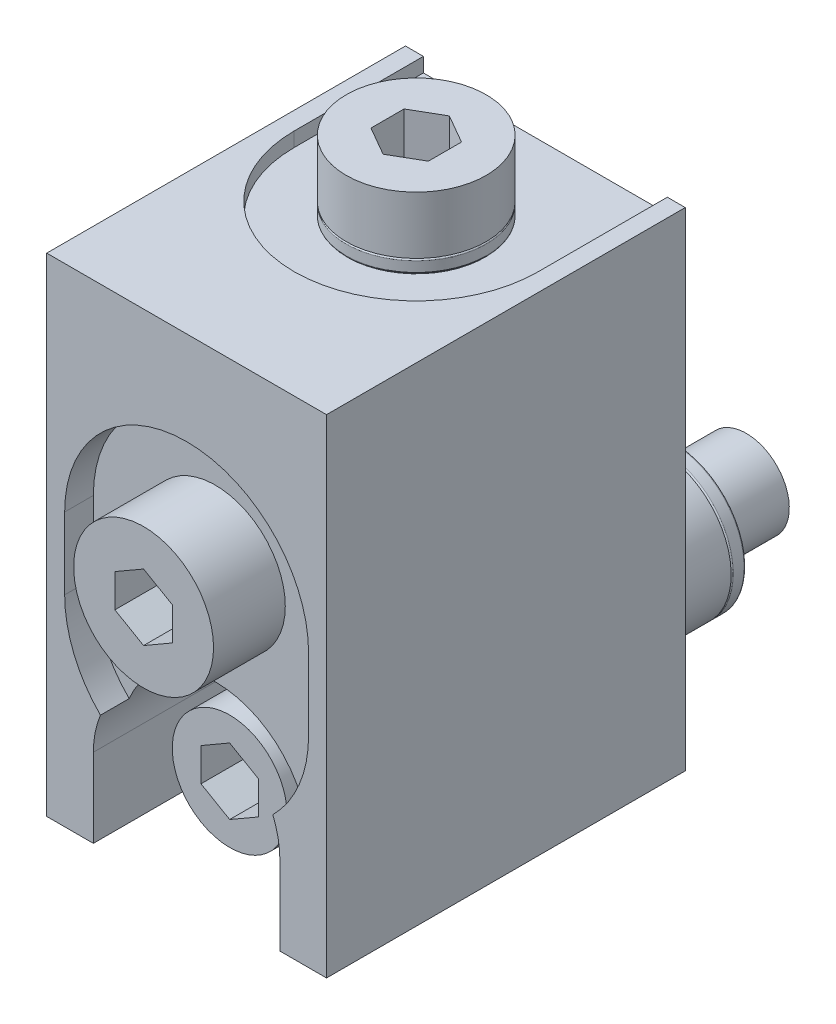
ISO-10303-21;
HEADER;
FILE_DESCRIPTION(('STEP AP214'),'2;1');
FILE_NAME('part.step','',(''),(''),'','','');
FILE_SCHEMA(('AUTOMOTIVE_DESIGN { 1 0 10303 214 1 1 1 1 }'));
ENDSEC;
DATA;
#1=APPLICATION_CONTEXT('core data for automotive mechanical design processes');
#2=APPLICATION_PROTOCOL_DEFINITION('international standard','automotive_design',2000,#1);
#3=PRODUCT_CONTEXT('',#1,'mechanical');
#4=PRODUCT('Part','Part','',(#3));
#5=PRODUCT_RELATED_PRODUCT_CATEGORY('part','',(#4));
#6=PRODUCT_DEFINITION_FORMATION('','',#4);
#7=PRODUCT_DEFINITION_CONTEXT('part definition',#1,'design');
#8=PRODUCT_DEFINITION('design','',#6,#7);
#9=PRODUCT_DEFINITION_SHAPE('','',#8);
#10=(LENGTH_UNIT() NAMED_UNIT(*) SI_UNIT(.MILLI.,.METRE.));
#11=(NAMED_UNIT(*) PLANE_ANGLE_UNIT() SI_UNIT($,.RADIAN.));
#12=(NAMED_UNIT(*) SI_UNIT($,.STERADIAN.) SOLID_ANGLE_UNIT());
#13=UNCERTAINTY_MEASURE_WITH_UNIT(LENGTH_MEASURE(1.E-05),#10,'distance_accuracy_value','');
#14=(GEOMETRIC_REPRESENTATION_CONTEXT(3) GLOBAL_UNCERTAINTY_ASSIGNED_CONTEXT((#13)) GLOBAL_UNIT_ASSIGNED_CONTEXT((#10,
#11,#12)) REPRESENTATION_CONTEXT('',''));
#15=CARTESIAN_POINT('',(0.,0.,0.));
#16=DIRECTION('',(0.,0.,1.));
#17=DIRECTION('',(1.,0.,0.));
#18=AXIS2_PLACEMENT_3D('',#15,#16,#17);
#19=CARTESIAN_POINT('',(9.75,33.,9.));
#20=DIRECTION('',(0.,1.,0.));
#21=DIRECTION('',(0.,0.,1.));
#22=AXIS2_PLACEMENT_3D('',#19,#20,#21);
#23=PLANE('',#22);
#24=CARTESIAN_POINT('',(9.75,33.,9.));
#25=DIRECTION('',(0.,1.,0.));
#26=DIRECTION('',(0.,0.,1.));
#27=AXIS2_PLACEMENT_3D('',#24,#25,#26);
#28=CIRCLE('',#27,8.5);
#29=CARTESIAN_POINT('',(1.25,33.,9.));
#30=VERTEX_POINT('',#29);
#31=CARTESIAN_POINT('',(18.25,33.,9.));
#32=VERTEX_POINT('',#31);
#33=EDGE_CURVE('E439',#30,#32,#28,.T.);
#34=ORIENTED_EDGE('',*,*,#33,.T.);
#35=DIRECTION('',(0.,0.,-1.));
#36=VECTOR('',#35,1.);
#37=CARTESIAN_POINT('',(18.25,33.,9.));
#38=LINE('',#37,#36);
#39=CARTESIAN_POINT('',(18.25,33.,0.));
#40=VERTEX_POINT('',#39);
#41=EDGE_CURVE('E442',#32,#40,#38,.T.);
#42=ORIENTED_EDGE('',*,*,#41,.T.);
#43=DIRECTION('',(-1.,0.,0.));
#44=VECTOR('',#43,1.);
#45=CARTESIAN_POINT('',(18.25,33.,0.));
#46=LINE('',#45,#44);
#47=CARTESIAN_POINT('',(1.25,33.,0.));
#48=VERTEX_POINT('',#47);
#49=EDGE_CURVE('E445',#40,#48,#46,.T.);
#50=ORIENTED_EDGE('',*,*,#49,.T.);
#51=DIRECTION('',(0.,0.,1.));
#52=VECTOR('',#51,1.);
#53=CARTESIAN_POINT('',(1.25,33.,9.));
#54=LINE('',#53,#52);
#55=EDGE_CURVE('E447',#48,#30,#54,.T.);
#56=ORIENTED_EDGE('',*,*,#55,.T.);
#57=EDGE_LOOP('',(#34,#42,#50,#56));
#58=FACE_BOUND('',#57,.T.);
#59=CARTESIAN_POINT('',(9.75,33.,9.));
#60=DIRECTION('',(0.,1.,0.));
#61=DIRECTION('',(0.,0.,1.));
#62=AXIS2_PLACEMENT_3D('',#59,#60,#61);
#63=CIRCLE('',#62,4.775);
#64=CARTESIAN_POINT('',(9.75,33.,13.775));
#65=VERTEX_POINT('',#64);
#66=EDGE_CURVE('E621',#65,#65,#63,.T.);
#67=ORIENTED_EDGE('',*,*,#66,.F.);
#68=EDGE_LOOP('',(#67));
#69=FACE_BOUND('',#68,.T.);
#70=ADVANCED_FACE('F39',(#58,#69),#23,.T.);
#71=CARTESIAN_POINT('',(9.75,19.,23.));
#72=DIRECTION('',(0.,0.,1.));
#73=DIRECTION('',(1.,0.,0.));
#74=AXIS2_PLACEMENT_3D('',#71,#72,#73);
#75=PLANE('',#74);
#76=CARTESIAN_POINT('',(9.75,5.5,23.));
#77=DIRECTION('',(0.,0.,1.));
#78=DIRECTION('',(1.,0.,0.));
#79=AXIS2_PLACEMENT_3D('',#76,#77,#78);
#80=CIRCLE('',#79,6.5);
#81=CARTESIAN_POINT('',(3.74389367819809,7.98529411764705,23.));
#82=VERTEX_POINT('',#81);
#83=CARTESIAN_POINT('',(15.7561063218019,7.98529411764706,23.));
#84=VERTEX_POINT('',#83);
#85=EDGE_CURVE('E561',#82,#84,#80,.F.);
#86=ORIENTED_EDGE('',*,*,#85,.T.);
#87=CARTESIAN_POINT('',(9.75,14.,23.));
#88=DIRECTION('',(0.,0.,1.));
#89=DIRECTION('',(1.,0.,0.));
#90=AXIS2_PLACEMENT_3D('',#87,#88,#89);
#91=CIRCLE('',#90,8.5);
#92=CARTESIAN_POINT('',(18.25,14.,23.));
#93=VERTEX_POINT('',#92);
#94=EDGE_CURVE('E473',#84,#93,#91,.T.);
#95=ORIENTED_EDGE('',*,*,#94,.T.);
#96=DIRECTION('',(0.,1.,0.));
#97=VECTOR('',#96,1.);
#98=CARTESIAN_POINT('',(18.25,19.,23.));
#99=LINE('',#98,#97);
#100=CARTESIAN_POINT('',(18.25,19.,23.));
#101=VERTEX_POINT('',#100);
#102=EDGE_CURVE('E476',#93,#101,#99,.T.);
#103=ORIENTED_EDGE('',*,*,#102,.T.);
#104=CARTESIAN_POINT('',(9.75,19.,23.));
#105=DIRECTION('',(0.,0.,1.));
#106=DIRECTION('',(1.,0.,0.));
#107=AXIS2_PLACEMENT_3D('',#104,#105,#106);
#108=CIRCLE('',#107,8.5);
#109=CARTESIAN_POINT('',(1.25,19.,23.));
#110=VERTEX_POINT('',#109);
#111=EDGE_CURVE('E466',#101,#110,#108,.T.);
#112=ORIENTED_EDGE('',*,*,#111,.T.);
#113=DIRECTION('',(0.,-1.,0.));
#114=VECTOR('',#113,1.);
#115=CARTESIAN_POINT('',(1.25,19.,23.));
#116=LINE('',#115,#114);
#117=CARTESIAN_POINT('',(1.25,14.,23.));
#118=VERTEX_POINT('',#117);
#119=EDGE_CURVE('E469',#110,#118,#116,.T.);
#120=ORIENTED_EDGE('',*,*,#119,.T.);
#121=EDGE_CURVE('E474',#118,#82,#91,.T.);
#122=ORIENTED_EDGE('',*,*,#121,.T.);
#123=EDGE_LOOP('',(#86,#95,#103,#112,#120,#122));
#124=FACE_BOUND('',#123,.T.);
#125=CARTESIAN_POINT('',(9.75,19.,23.));
#126=DIRECTION('',(0.,0.,1.));
#127=DIRECTION('',(1.,0.,0.));
#128=AXIS2_PLACEMENT_3D('',#125,#126,#127);
#129=CIRCLE('',#128,4.875);
#130=CARTESIAN_POINT('',(14.625,19.,23.));
#131=VERTEX_POINT('',#130);
#132=EDGE_CURVE('E426',#131,#131,#129,.T.);
#133=ORIENTED_EDGE('',*,*,#132,.F.);
#134=EDGE_LOOP('',(#133));
#135=FACE_BOUND('',#134,.T.);
#136=ADVANCED_FACE('F704',(#124,#135),#75,.T.);
#137=CARTESIAN_POINT('',(9.75,5.5,15.));
#138=DIRECTION('',(0.,0.,1.));
#139=DIRECTION('',(1.,0.,0.));
#140=AXIS2_PLACEMENT_3D('',#137,#138,#139);
#141=PLANE('',#140);
#142=CARTESIAN_POINT('',(9.75,5.5,15.));
#143=DIRECTION('',(0.,0.,1.));
#144=DIRECTION('',(1.,0.,0.));
#145=AXIS2_PLACEMENT_3D('',#142,#143,#144);
#146=CIRCLE('',#145,6.5);
#147=CARTESIAN_POINT('',(16.25,5.5,15.));
#148=VERTEX_POINT('',#147);
#149=CARTESIAN_POINT('',(3.25,5.5,15.));
#150=VERTEX_POINT('',#149);
#151=EDGE_CURVE('E499',#148,#150,#146,.T.);
#152=ORIENTED_EDGE('',*,*,#151,.T.);
#153=DIRECTION('',(0.,-1.,0.));
#154=VECTOR('',#153,1.);
#155=CARTESIAN_POINT('',(3.25,5.5,15.));
#156=LINE('',#155,#154);
#157=CARTESIAN_POINT('',(3.25,0.,15.));
#158=VERTEX_POINT('',#157);
#159=EDGE_CURVE('E502',#150,#158,#156,.T.);
#160=ORIENTED_EDGE('',*,*,#159,.T.);
#161=DIRECTION('',(1.,0.,0.));
#162=VECTOR('',#161,1.);
#163=CARTESIAN_POINT('',(3.25,0.,15.));
#164=LINE('',#163,#162);
#165=CARTESIAN_POINT('',(16.25,0.,15.));
#166=VERTEX_POINT('',#165);
#167=EDGE_CURVE('E506',#158,#166,#164,.T.);
#168=ORIENTED_EDGE('',*,*,#167,.T.);
#169=DIRECTION('',(0.,1.,0.));
#170=VECTOR('',#169,1.);
#171=CARTESIAN_POINT('',(16.25,0.,15.));
#172=LINE('',#171,#170);
#173=EDGE_CURVE('E508',#166,#148,#172,.T.);
#174=ORIENTED_EDGE('',*,*,#173,.T.);
#175=EDGE_LOOP('',(#152,#160,#168,#174));
#176=FACE_BOUND('',#175,.T.);
#177=CARTESIAN_POINT('',(9.75,5.5,15.));
#178=DIRECTION('',(0.,0.,1.));
#179=DIRECTION('',(1.,0.,0.));
#180=AXIS2_PLACEMENT_3D('',#177,#178,#179);
#181=CIRCLE('',#180,4.);
#182=CARTESIAN_POINT('',(13.75,5.5,15.));
#183=VERTEX_POINT('',#182);
#184=EDGE_CURVE('E430',#183,#183,#181,.T.);
#185=ORIENTED_EDGE('',*,*,#184,.F.);
#186=EDGE_LOOP('',(#185));
#187=FACE_BOUND('',#186,.T.);
#188=ADVANCED_FACE('F710',(#176,#187),#141,.T.);
#189=CARTESIAN_POINT('',(19.5,0.,25.));
#190=DIRECTION('',(0.,1.,0.));
#191=DIRECTION('',(-1.,0.,0.));
#192=AXIS2_PLACEMENT_3D('',#189,#190,#191);
#193=PLANE('',#192);
#194=DIRECTION('',(1.,0.,0.));
#195=VECTOR('',#194,1.);
#196=CARTESIAN_POINT('',(19.5,0.,25.));
#197=LINE('',#196,#195);
#198=CARTESIAN_POINT('',(16.25,0.,25.));
#199=VERTEX_POINT('',#198);
#200=CARTESIAN_POINT('',(19.5,0.,25.));
#201=VERTEX_POINT('',#200);
#202=EDGE_CURVE('E533',#199,#201,#197,.T.);
#203=ORIENTED_EDGE('',*,*,#202,.F.);
#204=DIRECTION('',(0.,0.,1.));
#205=VECTOR('',#204,1.);
#206=CARTESIAN_POINT('',(16.25,0.,15.));
#207=LINE('',#206,#205);
#208=EDGE_CURVE('E522',#166,#199,#207,.T.);
#209=ORIENTED_EDGE('',*,*,#208,.F.);
#210=ORIENTED_EDGE('',*,*,#167,.F.);
#211=DIRECTION('',(0.,0.,1.));
#212=VECTOR('',#211,1.);
#213=CARTESIAN_POINT('',(3.25,0.,15.));
#214=LINE('',#213,#212);
#215=CARTESIAN_POINT('',(3.25,0.,25.));
#216=VERTEX_POINT('',#215);
#217=EDGE_CURVE('E524',#158,#216,#214,.T.);
#218=ORIENTED_EDGE('',*,*,#217,.T.);
#219=CARTESIAN_POINT('',(0.,0.,25.));
#220=VERTEX_POINT('',#219);
#221=EDGE_CURVE('E529',#220,#216,#197,.T.);
#222=ORIENTED_EDGE('',*,*,#221,.F.);
#223=DIRECTION('',(0.,0.,-1.));
#224=VECTOR('',#223,1.);
#225=CARTESIAN_POINT('',(0.,0.,25.));
#226=LINE('',#225,#224);
#227=CARTESIAN_POINT('',(0.,0.,0.));
#228=VERTEX_POINT('',#227);
#229=EDGE_CURVE('E539',#220,#228,#226,.T.);
#230=ORIENTED_EDGE('',*,*,#229,.T.);
#231=DIRECTION('',(1.,0.,0.));
#232=VECTOR('',#231,1.);
#233=CARTESIAN_POINT('',(19.5,0.,0.));
#234=LINE('',#233,#232);
#235=CARTESIAN_POINT('',(19.5,0.,0.));
#236=VERTEX_POINT('',#235);
#237=EDGE_CURVE('E521',#228,#236,#234,.T.);
#238=ORIENTED_EDGE('',*,*,#237,.T.);
#239=DIRECTION('',(0.,0.,-1.));
#240=VECTOR('',#239,1.);
#241=CARTESIAN_POINT('',(19.5,0.,25.));
#242=LINE('',#241,#240);
#243=EDGE_CURVE('E558',#201,#236,#242,.T.);
#244=ORIENTED_EDGE('',*,*,#243,.F.);
#245=EDGE_LOOP('',(#203,#209,#210,#218,#222,#230,#238,#244));
#246=FACE_BOUND('',#245,.T.);
#247=ADVANCED_FACE('F750',(#246),#193,.F.);
#248=CARTESIAN_POINT('',(19.5,34.,25.));
#249=DIRECTION('',(-1.,0.,0.));
#250=DIRECTION('',(0.,-1.,0.));
#251=AXIS2_PLACEMENT_3D('',#248,#249,#250);
#252=PLANE('',#251);
#253=DIRECTION('',(0.,1.,0.));
#254=VECTOR('',#253,1.);
#255=CARTESIAN_POINT('',(19.5,34.,0.));
#256=LINE('',#255,#254);
#257=CARTESIAN_POINT('',(19.5,34.,0.));
#258=VERTEX_POINT('',#257);
#259=EDGE_CURVE('E542',#236,#258,#256,.T.);
#260=ORIENTED_EDGE('',*,*,#259,.T.);
#261=DIRECTION('',(0.,0.,-1.));
#262=VECTOR('',#261,1.);
#263=CARTESIAN_POINT('',(19.5,34.,25.));
#264=LINE('',#263,#262);
#265=CARTESIAN_POINT('',(19.5,34.,25.));
#266=VERTEX_POINT('',#265);
#267=EDGE_CURVE('E555',#266,#258,#264,.T.);
#268=ORIENTED_EDGE('',*,*,#267,.F.);
#269=DIRECTION('',(0.,1.,0.));
#270=VECTOR('',#269,1.);
#271=CARTESIAN_POINT('',(19.5,34.,25.));
#272=LINE('',#271,#270);
#273=EDGE_CURVE('E532',#201,#266,#272,.T.);
#274=ORIENTED_EDGE('',*,*,#273,.F.);
#275=ORIENTED_EDGE('',*,*,#243,.T.);
#276=EDGE_LOOP('',(#260,#268,#274,#275));
#277=FACE_BOUND('',#276,.T.);
#278=ADVANCED_FACE('F779',(#277),#252,.F.);
#279=CARTESIAN_POINT('',(0.,34.,25.));
#280=DIRECTION('',(0.,-1.,0.));
#281=DIRECTION('',(0.,0.,-1.));
#282=AXIS2_PLACEMENT_3D('',#279,#280,#281);
#283=PLANE('',#282);
#284=CARTESIAN_POINT('',(9.75,34.,9.));
#285=DIRECTION('',(0.,1.,0.));
#286=DIRECTION('',(0.,0.,1.));
#287=AXIS2_PLACEMENT_3D('',#284,#285,#286);
#288=CIRCLE('',#287,8.5);
#289=CARTESIAN_POINT('',(1.25,34.,9.));
#290=VERTEX_POINT('',#289);
#291=CARTESIAN_POINT('',(18.25,34.,9.));
#292=VERTEX_POINT('',#291);
#293=EDGE_CURVE('E436',#290,#292,#288,.T.);
#294=ORIENTED_EDGE('',*,*,#293,.F.);
#295=DIRECTION('',(0.,0.,1.));
#296=VECTOR('',#295,1.);
#297=CARTESIAN_POINT('',(1.25,34.,9.));
#298=LINE('',#297,#296);
#299=CARTESIAN_POINT('',(1.25,34.,0.));
#300=VERTEX_POINT('',#299);
#301=EDGE_CURVE('E443',#300,#290,#298,.T.);
#302=ORIENTED_EDGE('',*,*,#301,.F.);
#303=DIRECTION('',(-1.,0.,0.));
#304=VECTOR('',#303,1.);
#305=CARTESIAN_POINT('',(0.,34.,0.));
#306=LINE('',#305,#304);
#307=CARTESIAN_POINT('',(0.,34.,0.));
#308=VERTEX_POINT('',#307);
#309=EDGE_CURVE('E544',#300,#308,#306,.T.);
#310=ORIENTED_EDGE('',*,*,#309,.T.);
#311=DIRECTION('',(0.,0.,-1.));
#312=VECTOR('',#311,1.);
#313=CARTESIAN_POINT('',(0.,34.,25.));
#314=LINE('',#313,#312);
#315=CARTESIAN_POINT('',(0.,34.,25.));
#316=VERTEX_POINT('',#315);
#317=EDGE_CURVE('E552',#316,#308,#314,.T.);
#318=ORIENTED_EDGE('',*,*,#317,.F.);
#319=DIRECTION('',(-1.,0.,0.));
#320=VECTOR('',#319,1.);
#321=CARTESIAN_POINT('',(0.,34.,25.));
#322=LINE('',#321,#320);
#323=EDGE_CURVE('E535',#266,#316,#322,.T.);
#324=ORIENTED_EDGE('',*,*,#323,.F.);
#325=ORIENTED_EDGE('',*,*,#267,.T.);
#326=CARTESIAN_POINT('',(18.25,34.,0.));
#327=VERTEX_POINT('',#326);
#328=EDGE_CURVE('E545',#258,#327,#306,.T.);
#329=ORIENTED_EDGE('',*,*,#328,.T.);
#330=DIRECTION('',(0.,0.,-1.));
#331=VECTOR('',#330,1.);
#332=CARTESIAN_POINT('',(18.25,34.,9.));
#333=LINE('',#332,#331);
#334=EDGE_CURVE('E453',#292,#327,#333,.T.);
#335=ORIENTED_EDGE('',*,*,#334,.F.);
#336=EDGE_LOOP('',(#294,#302,#310,#318,#324,#325,#329,#335));
#337=FACE_BOUND('',#336,.T.);
#338=ADVANCED_FACE('F775',(#337),#283,.F.);
#339=CARTESIAN_POINT('',(0.,0.,25.));
#340=DIRECTION('',(1.,0.,0.));
#341=DIRECTION('',(0.,0.,-1.));
#342=AXIS2_PLACEMENT_3D('',#339,#340,#341);
#343=PLANE('',#342);
#344=DIRECTION('',(0.,-1.,0.));
#345=VECTOR('',#344,1.);
#346=CARTESIAN_POINT('',(0.,0.,0.));
#347=LINE('',#346,#345);
#348=EDGE_CURVE('E548',#308,#228,#347,.T.);
#349=ORIENTED_EDGE('',*,*,#348,.T.);
#350=ORIENTED_EDGE('',*,*,#229,.F.);
#351=DIRECTION('',(0.,-1.,0.));
#352=VECTOR('',#351,1.);
#353=CARTESIAN_POINT('',(0.,0.,25.));
#354=LINE('',#353,#352);
#355=EDGE_CURVE('E537',#316,#220,#354,.T.);
#356=ORIENTED_EDGE('',*,*,#355,.F.);
#357=ORIENTED_EDGE('',*,*,#317,.T.);
#358=EDGE_LOOP('',(#349,#350,#356,#357));
#359=FACE_BOUND('',#358,.T.);
#360=ADVANCED_FACE('F767',(#359),#343,.F.);
#361=CARTESIAN_POINT('',(0.,0.,25.));
#362=DIRECTION('',(0.,0.,-1.));
#363=DIRECTION('',(-1.,0.,0.));
#364=AXIS2_PLACEMENT_3D('',#361,#362,#363);
#365=PLANE('',#364);
#366=DIRECTION('',(0.,1.,0.));
#367=VECTOR('',#366,1.);
#368=CARTESIAN_POINT('',(18.25,19.,25.));
#369=LINE('',#368,#367);
#370=CARTESIAN_POINT('',(18.25,14.,25.));
#371=VERTEX_POINT('',#370);
#372=CARTESIAN_POINT('',(18.25,19.,25.));
#373=VERTEX_POINT('',#372);
#374=EDGE_CURVE('E470',#371,#373,#369,.T.);
#375=ORIENTED_EDGE('',*,*,#374,.F.);
#376=CARTESIAN_POINT('',(9.75,14.,25.));
#377=DIRECTION('',(0.,0.,1.));
#378=DIRECTION('',(1.,0.,0.));
#379=AXIS2_PLACEMENT_3D('',#376,#377,#378);
#380=CIRCLE('',#379,8.5);
#381=CARTESIAN_POINT('',(15.7561063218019,7.98529411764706,25.));
#382=VERTEX_POINT('',#381);
#383=EDGE_CURVE('E485',#382,#371,#380,.T.);
#384=ORIENTED_EDGE('',*,*,#383,.F.);
#385=CARTESIAN_POINT('',(9.75,5.5,25.));
#386=DIRECTION('',(0.,0.,1.));
#387=DIRECTION('',(1.,0.,0.));
#388=AXIS2_PLACEMENT_3D('',#385,#386,#387);
#389=CIRCLE('',#388,6.5);
#390=CARTESIAN_POINT('',(16.25,5.5,25.));
#391=VERTEX_POINT('',#390);
#392=EDGE_CURVE('E512',#391,#382,#389,.T.);
#393=ORIENTED_EDGE('',*,*,#392,.F.);
#394=DIRECTION('',(0.,1.,0.));
#395=VECTOR('',#394,1.);
#396=CARTESIAN_POINT('',(16.25,0.,25.));
#397=LINE('',#396,#395);
#398=EDGE_CURVE('E503',#199,#391,#397,.T.);
#399=ORIENTED_EDGE('',*,*,#398,.F.);
#400=ORIENTED_EDGE('',*,*,#202,.T.);
#401=ORIENTED_EDGE('',*,*,#273,.T.);
#402=ORIENTED_EDGE('',*,*,#323,.T.);
#403=ORIENTED_EDGE('',*,*,#355,.T.);
#404=ORIENTED_EDGE('',*,*,#221,.T.);
#405=DIRECTION('',(0.,-1.,0.));
#406=VECTOR('',#405,1.);
#407=CARTESIAN_POINT('',(3.25,5.5,25.));
#408=LINE('',#407,#406);
#409=CARTESIAN_POINT('',(3.25,5.5,25.));
#410=VERTEX_POINT('',#409);
#411=EDGE_CURVE('E515',#410,#216,#408,.T.);
#412=ORIENTED_EDGE('',*,*,#411,.F.);
#413=CARTESIAN_POINT('',(3.74389367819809,7.98529411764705,25.));
#414=VERTEX_POINT('',#413);
#415=EDGE_CURVE('E492',#414,#410,#389,.T.);
#416=ORIENTED_EDGE('',*,*,#415,.F.);
#417=CARTESIAN_POINT('',(1.25,14.,25.));
#418=VERTEX_POINT('',#417);
#419=EDGE_CURVE('E486',#418,#414,#380,.T.);
#420=ORIENTED_EDGE('',*,*,#419,.F.);
#421=DIRECTION('',(0.,-1.,0.));
#422=VECTOR('',#421,1.);
#423=CARTESIAN_POINT('',(1.25,19.,25.));
#424=LINE('',#423,#422);
#425=CARTESIAN_POINT('',(1.25,19.,25.));
#426=VERTEX_POINT('',#425);
#427=EDGE_CURVE('E482',#426,#418,#424,.T.);
#428=ORIENTED_EDGE('',*,*,#427,.F.);
#429=CARTESIAN_POINT('',(9.75,19.,25.));
#430=DIRECTION('',(0.,0.,1.));
#431=DIRECTION('',(1.,0.,0.));
#432=AXIS2_PLACEMENT_3D('',#429,#430,#431);
#433=CIRCLE('',#432,8.5);
#434=EDGE_CURVE('E459',#373,#426,#433,.T.);
#435=ORIENTED_EDGE('',*,*,#434,.F.);
#436=EDGE_LOOP('',(#375,#384,#393,#399,#400,#401,#402,#403,#404,#412,#416,#420,#428,#435));
#437=FACE_BOUND('',#436,.T.);
#438=ADVANCED_FACE('F764',(#437),#365,.F.);
#439=CARTESIAN_POINT('',(0.,0.,0.));
#440=DIRECTION('',(0.,0.,-1.));
#441=DIRECTION('',(-1.,0.,0.));
#442=AXIS2_PLACEMENT_3D('',#439,#440,#441);
#443=PLANE('',#442);
#444=CARTESIAN_POINT('',(9.75,5.5,0.));
#445=DIRECTION('',(0.,0.,-1.));
#446=DIRECTION('',(-1.,0.,0.));
#447=AXIS2_PLACEMENT_3D('',#444,#445,#446);
#448=CIRCLE('',#447,4.9);
#449=CARTESIAN_POINT('',(4.85,5.5,0.));
#450=VERTEX_POINT('',#449);
#451=EDGE_CURVE('E569',#450,#450,#448,.T.);
#452=ORIENTED_EDGE('',*,*,#451,.F.);
#453=EDGE_LOOP('',(#452));
#454=FACE_BOUND('',#453,.T.);
#455=DIRECTION('',(0.,1.,0.));
#456=VECTOR('',#455,1.);
#457=CARTESIAN_POINT('',(1.25,33.,0.));
#458=LINE('',#457,#456);
#459=EDGE_CURVE('E460',#48,#300,#458,.T.);
#460=ORIENTED_EDGE('',*,*,#459,.F.);
#461=ORIENTED_EDGE('',*,*,#49,.F.);
#462=DIRECTION('',(0.,1.,0.));
#463=VECTOR('',#462,1.);
#464=CARTESIAN_POINT('',(18.25,33.,0.));
#465=LINE('',#464,#463);
#466=EDGE_CURVE('E462',#40,#327,#465,.T.);
#467=ORIENTED_EDGE('',*,*,#466,.T.);
#468=ORIENTED_EDGE('',*,*,#328,.F.);
#469=ORIENTED_EDGE('',*,*,#259,.F.);
#470=ORIENTED_EDGE('',*,*,#237,.F.);
#471=ORIENTED_EDGE('',*,*,#348,.F.);
#472=ORIENTED_EDGE('',*,*,#309,.F.);
#473=EDGE_LOOP('',(#460,#461,#467,#468,#469,#470,#471,#472));
#474=FACE_BOUND('',#473,.T.);
#475=ADVANCED_FACE('F762',(#454,#474),#443,.T.);
#476=CARTESIAN_POINT('',(9.75,5.5,15.));
#477=DIRECTION('',(0.,0.,1.));
#478=DIRECTION('',(1.,0.,0.));
#479=AXIS2_PLACEMENT_3D('',#476,#477,#478);
#480=CYLINDRICAL_SURFACE('',#479,6.5);
#481=ORIENTED_EDGE('',*,*,#85,.F.);
#482=DIRECTION('',(0.,0.,1.));
#483=VECTOR('',#482,1.);
#484=CARTESIAN_POINT('',(3.74389367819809,7.98529411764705,24.));
#485=LINE('',#484,#483);
#486=EDGE_CURVE('E566',#82,#414,#485,.T.);
#487=ORIENTED_EDGE('',*,*,#486,.T.);
#488=ORIENTED_EDGE('',*,*,#415,.T.);
#489=DIRECTION('',(0.,0.,1.));
#490=VECTOR('',#489,1.);
#491=CARTESIAN_POINT('',(3.25,5.5,15.));
#492=LINE('',#491,#490);
#493=EDGE_CURVE('E511',#150,#410,#492,.T.);
#494=ORIENTED_EDGE('',*,*,#493,.F.);
#495=ORIENTED_EDGE('',*,*,#151,.F.);
#496=DIRECTION('',(0.,0.,1.));
#497=VECTOR('',#496,1.);
#498=CARTESIAN_POINT('',(16.25,5.5,15.));
#499=LINE('',#498,#497);
#500=EDGE_CURVE('E519',#148,#391,#499,.T.);
#501=ORIENTED_EDGE('',*,*,#500,.T.);
#502=ORIENTED_EDGE('',*,*,#392,.T.);
#503=DIRECTION('',(0.,0.,1.));
#504=VECTOR('',#503,1.);
#505=CARTESIAN_POINT('',(15.7561063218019,7.98529411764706,24.));
#506=LINE('',#505,#504);
#507=EDGE_CURVE('E563',#382,#84,#506,.F.);
#508=ORIENTED_EDGE('',*,*,#507,.T.);
#509=EDGE_LOOP('',(#481,#487,#488,#494,#495,#501,#502,#508));
#510=FACE_BOUND('',#509,.T.);
#511=ADVANCED_FACE('F755',(#510),#480,.F.);
#512=CARTESIAN_POINT('',(16.25,0.,15.));
#513=DIRECTION('',(1.,0.,0.));
#514=DIRECTION('',(0.,0.,-1.));
#515=AXIS2_PLACEMENT_3D('',#512,#513,#514);
#516=PLANE('',#515);
#517=ORIENTED_EDGE('',*,*,#398,.T.);
#518=ORIENTED_EDGE('',*,*,#500,.F.);
#519=ORIENTED_EDGE('',*,*,#173,.F.);
#520=ORIENTED_EDGE('',*,*,#208,.T.);
#521=EDGE_LOOP('',(#517,#518,#519,#520));
#522=FACE_BOUND('',#521,.T.);
#523=ADVANCED_FACE('F752',(#522),#516,.F.);
#524=CARTESIAN_POINT('',(3.25,5.5,15.));
#525=DIRECTION('',(-1.,0.,0.));
#526=DIRECTION('',(0.,0.,1.));
#527=AXIS2_PLACEMENT_3D('',#524,#525,#526);
#528=PLANE('',#527);
#529=ORIENTED_EDGE('',*,*,#411,.T.);
#530=ORIENTED_EDGE('',*,*,#217,.F.);
#531=ORIENTED_EDGE('',*,*,#159,.F.);
#532=ORIENTED_EDGE('',*,*,#493,.T.);
#533=EDGE_LOOP('',(#529,#530,#531,#532));
#534=FACE_BOUND('',#533,.T.);
#535=ADVANCED_FACE('F740',(#534),#528,.F.);
#536=CARTESIAN_POINT('',(9.75,14.,23.));
#537=DIRECTION('',(0.,0.,1.));
#538=DIRECTION('',(1.,0.,0.));
#539=AXIS2_PLACEMENT_3D('',#536,#537,#538);
#540=CYLINDRICAL_SURFACE('',#539,8.5);
#541=ORIENTED_EDGE('',*,*,#121,.F.);
#542=DIRECTION('',(0.,0.,1.));
#543=VECTOR('',#542,1.);
#544=CARTESIAN_POINT('',(1.25,14.,23.));
#545=LINE('',#544,#543);
#546=EDGE_CURVE('E496',#118,#418,#545,.T.);
#547=ORIENTED_EDGE('',*,*,#546,.T.);
#548=ORIENTED_EDGE('',*,*,#419,.T.);
#549=ORIENTED_EDGE('',*,*,#486,.F.);
#550=EDGE_LOOP('',(#541,#547,#548,#549));
#551=FACE_BOUND('',#550,.T.);
#552=ADVANCED_FACE('F736',(#551),#540,.F.);
#553=ORIENTED_EDGE('',*,*,#383,.T.);
#554=DIRECTION('',(0.,0.,1.));
#555=VECTOR('',#554,1.);
#556=CARTESIAN_POINT('',(18.25,14.,23.));
#557=LINE('',#556,#555);
#558=EDGE_CURVE('E493',#93,#371,#557,.T.);
#559=ORIENTED_EDGE('',*,*,#558,.F.);
#560=ORIENTED_EDGE('',*,*,#94,.F.);
#561=ORIENTED_EDGE('',*,*,#507,.F.);
#562=EDGE_LOOP('',(#553,#559,#560,#561));
#563=FACE_BOUND('',#562,.T.);
#564=ADVANCED_FACE('F739',(#563),#540,.F.);
#565=CARTESIAN_POINT('',(9.75,19.,23.));
#566=DIRECTION('',(0.,0.,1.));
#567=DIRECTION('',(1.,0.,0.));
#568=AXIS2_PLACEMENT_3D('',#565,#566,#567);
#569=CYLINDRICAL_SURFACE('',#568,8.5);
#570=ORIENTED_EDGE('',*,*,#434,.T.);
#571=DIRECTION('',(0.,0.,1.));
#572=VECTOR('',#571,1.);
#573=CARTESIAN_POINT('',(1.25,19.,23.));
#574=LINE('',#573,#572);
#575=EDGE_CURVE('E479',#110,#426,#574,.T.);
#576=ORIENTED_EDGE('',*,*,#575,.F.);
#577=ORIENTED_EDGE('',*,*,#111,.F.);
#578=DIRECTION('',(0.,0.,1.));
#579=VECTOR('',#578,1.);
#580=CARTESIAN_POINT('',(18.25,19.,23.));
#581=LINE('',#580,#579);
#582=EDGE_CURVE('E490',#101,#373,#581,.T.);
#583=ORIENTED_EDGE('',*,*,#582,.T.);
#584=EDGE_LOOP('',(#570,#576,#577,#583));
#585=FACE_BOUND('',#584,.T.);
#586=ADVANCED_FACE('F734',(#585),#569,.F.);
#587=CARTESIAN_POINT('',(18.25,19.,23.));
#588=DIRECTION('',(1.,0.,0.));
#589=DIRECTION('',(0.,0.,-1.));
#590=AXIS2_PLACEMENT_3D('',#587,#588,#589);
#591=PLANE('',#590);
#592=ORIENTED_EDGE('',*,*,#374,.T.);
#593=ORIENTED_EDGE('',*,*,#582,.F.);
#594=ORIENTED_EDGE('',*,*,#102,.F.);
#595=ORIENTED_EDGE('',*,*,#558,.T.);
#596=EDGE_LOOP('',(#592,#593,#594,#595));
#597=FACE_BOUND('',#596,.T.);
#598=ADVANCED_FACE('F731',(#597),#591,.F.);
#599=CARTESIAN_POINT('',(1.25,19.,23.));
#600=DIRECTION('',(-1.,0.,0.));
#601=DIRECTION('',(0.,0.,1.));
#602=AXIS2_PLACEMENT_3D('',#599,#600,#601);
#603=PLANE('',#602);
#604=ORIENTED_EDGE('',*,*,#427,.T.);
#605=ORIENTED_EDGE('',*,*,#546,.F.);
#606=ORIENTED_EDGE('',*,*,#119,.F.);
#607=ORIENTED_EDGE('',*,*,#575,.T.);
#608=EDGE_LOOP('',(#604,#605,#606,#607));
#609=FACE_BOUND('',#608,.T.);
#610=ADVANCED_FACE('F728',(#609),#603,.F.);
#611=CARTESIAN_POINT('',(9.75,33.,9.));
#612=DIRECTION('',(0.,1.,0.));
#613=DIRECTION('',(0.,0.,1.));
#614=AXIS2_PLACEMENT_3D('',#611,#612,#613);
#615=CYLINDRICAL_SURFACE('',#614,8.5);
#616=ORIENTED_EDGE('',*,*,#293,.T.);
#617=DIRECTION('',(0.,1.,0.));
#618=VECTOR('',#617,1.);
#619=CARTESIAN_POINT('',(18.25,33.,9.));
#620=LINE('',#619,#618);
#621=EDGE_CURVE('E450',#32,#292,#620,.T.);
#622=ORIENTED_EDGE('',*,*,#621,.F.);
#623=ORIENTED_EDGE('',*,*,#33,.F.);
#624=DIRECTION('',(0.,1.,0.));
#625=VECTOR('',#624,1.);
#626=CARTESIAN_POINT('',(1.25,33.,9.));
#627=LINE('',#626,#625);
#628=EDGE_CURVE('E457',#30,#290,#627,.T.);
#629=ORIENTED_EDGE('',*,*,#628,.T.);
#630=EDGE_LOOP('',(#616,#622,#623,#629));
#631=FACE_BOUND('',#630,.T.);
#632=ADVANCED_FACE('F722',(#631),#615,.F.);
#633=CARTESIAN_POINT('',(1.25,33.,9.));
#634=DIRECTION('',(-1.,0.,0.));
#635=DIRECTION('',(0.,0.,1.));
#636=AXIS2_PLACEMENT_3D('',#633,#634,#635);
#637=PLANE('',#636);
#638=ORIENTED_EDGE('',*,*,#301,.T.);
#639=ORIENTED_EDGE('',*,*,#628,.F.);
#640=ORIENTED_EDGE('',*,*,#55,.F.);
#641=ORIENTED_EDGE('',*,*,#459,.T.);
#642=EDGE_LOOP('',(#638,#639,#640,#641));
#643=FACE_BOUND('',#642,.T.);
#644=ADVANCED_FACE('F718',(#643),#637,.F.);
#645=CARTESIAN_POINT('',(18.25,33.,9.));
#646=DIRECTION('',(1.,0.,0.));
#647=DIRECTION('',(0.,0.,-1.));
#648=AXIS2_PLACEMENT_3D('',#645,#646,#647);
#649=PLANE('',#648);
#650=ORIENTED_EDGE('',*,*,#334,.T.);
#651=ORIENTED_EDGE('',*,*,#466,.F.);
#652=ORIENTED_EDGE('',*,*,#41,.F.);
#653=ORIENTED_EDGE('',*,*,#621,.T.);
#654=EDGE_LOOP('',(#650,#651,#652,#653));
#655=FACE_BOUND('',#654,.T.);
#656=ADVANCED_FACE('F721',(#655),#649,.F.);
#657=CARTESIAN_POINT('',(9.75,5.5,22.));
#658=DIRECTION('',(0.,0.,-1.));
#659=DIRECTION('',(-1.,0.,0.));
#660=AXIS2_PLACEMENT_3D('',#657,#658,#659);
#661=CYLINDRICAL_SURFACE('',#660,4.);
#662=CARTESIAN_POINT('',(9.75,5.5,22.));
#663=DIRECTION('',(0.,0.,1.));
#664=DIRECTION('',(1.,0.,0.));
#665=AXIS2_PLACEMENT_3D('',#662,#663,#664);
#666=CIRCLE('',#665,4.);
#667=CARTESIAN_POINT('',(13.75,5.5,22.));
#668=VERTEX_POINT('',#667);
#669=EDGE_CURVE('E433',#668,#668,#666,.T.);
#670=ORIENTED_EDGE('',*,*,#669,.F.);
#671=EDGE_LOOP('',(#670));
#672=FACE_BOUND('',#671,.T.);
#673=ORIENTED_EDGE('',*,*,#184,.T.);
#674=EDGE_LOOP('',(#673));
#675=FACE_BOUND('',#674,.T.);
#676=ADVANCED_FACE('F716',(#672,#675),#661,.T.);
#677=CARTESIAN_POINT('',(9.75,5.5,22.));
#678=DIRECTION('',(0.,0.,1.));
#679=DIRECTION('',(1.,0.,0.));
#680=AXIS2_PLACEMENT_3D('',#677,#678,#679);
#681=PLANE('',#680);
#682=DIRECTION('',(0.866025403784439,-0.5,0.));
#683=VECTOR('',#682,1.);
#684=CARTESIAN_POINT('',(7.75,4.34529946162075,22.));
#685=LINE('',#684,#683);
#686=CARTESIAN_POINT('',(7.75,4.34529946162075,22.));
#687=VERTEX_POINT('',#686);
#688=CARTESIAN_POINT('',(9.75,3.1905989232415,22.));
#689=VERTEX_POINT('',#688);
#690=EDGE_CURVE('E366',#687,#689,#685,.T.);
#691=ORIENTED_EDGE('',*,*,#690,.F.);
#692=DIRECTION('',(0.,-1.,0.));
#693=VECTOR('',#692,1.);
#694=CARTESIAN_POINT('',(7.75,6.65470053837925,22.));
#695=LINE('',#694,#693);
#696=CARTESIAN_POINT('',(7.75,6.65470053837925,22.));
#697=VERTEX_POINT('',#696);
#698=EDGE_CURVE('E380',#697,#687,#695,.T.);
#699=ORIENTED_EDGE('',*,*,#698,.F.);
#700=DIRECTION('',(-0.866025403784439,-0.5,0.));
#701=VECTOR('',#700,1.);
#702=CARTESIAN_POINT('',(9.75,7.80940107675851,22.));
#703=LINE('',#702,#701);
#704=CARTESIAN_POINT('',(9.75,7.80940107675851,22.));
#705=VERTEX_POINT('',#704);
#706=EDGE_CURVE('E406',#705,#697,#703,.T.);
#707=ORIENTED_EDGE('',*,*,#706,.F.);
#708=DIRECTION('',(-0.866025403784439,0.5,0.));
#709=VECTOR('',#708,1.);
#710=CARTESIAN_POINT('',(11.75,6.65470053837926,22.));
#711=LINE('',#710,#709);
#712=CARTESIAN_POINT('',(11.75,6.65470053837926,22.));
#713=VERTEX_POINT('',#712);
#714=EDGE_CURVE('E403',#713,#705,#711,.T.);
#715=ORIENTED_EDGE('',*,*,#714,.F.);
#716=DIRECTION('',(0.,1.,0.));
#717=VECTOR('',#716,1.);
#718=CARTESIAN_POINT('',(11.75,4.34529946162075,22.));
#719=LINE('',#718,#717);
#720=CARTESIAN_POINT('',(11.75,4.34529946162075,22.));
#721=VERTEX_POINT('',#720);
#722=EDGE_CURVE('E400',#721,#713,#719,.T.);
#723=ORIENTED_EDGE('',*,*,#722,.F.);
#724=DIRECTION('',(0.866025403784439,0.5,0.));
#725=VECTOR('',#724,1.);
#726=CARTESIAN_POINT('',(9.75,3.1905989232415,22.));
#727=LINE('',#726,#725);
#728=EDGE_CURVE('E397',#689,#721,#727,.T.);
#729=ORIENTED_EDGE('',*,*,#728,.F.);
#730=EDGE_LOOP('',(#691,#699,#707,#715,#723,#729));
#731=FACE_BOUND('',#730,.T.);
#732=ORIENTED_EDGE('',*,*,#669,.T.);
#733=EDGE_LOOP('',(#732));
#734=FACE_BOUND('',#733,.T.);
#735=ADVANCED_FACE('F863',(#731,#734),#681,.T.);
#736=CARTESIAN_POINT('',(9.75,19.,28.));
#737=DIRECTION('',(0.,0.,-1.));
#738=DIRECTION('',(-1.,0.,0.));
#739=AXIS2_PLACEMENT_3D('',#736,#737,#738);
#740=CYLINDRICAL_SURFACE('',#739,4.875);
#741=CARTESIAN_POINT('',(9.75,19.,28.));
#742=DIRECTION('',(0.,0.,1.));
#743=DIRECTION('',(1.,0.,0.));
#744=AXIS2_PLACEMENT_3D('',#741,#742,#743);
#745=CIRCLE('',#744,4.875);
#746=CARTESIAN_POINT('',(14.625,19.,28.));
#747=VERTEX_POINT('',#746);
#748=EDGE_CURVE('E427',#747,#747,#745,.T.);
#749=ORIENTED_EDGE('',*,*,#748,.F.);
#750=EDGE_LOOP('',(#749));
#751=FACE_BOUND('',#750,.T.);
#752=ORIENTED_EDGE('',*,*,#132,.T.);
#753=EDGE_LOOP('',(#752));
#754=FACE_BOUND('',#753,.T.);
#755=ADVANCED_FACE('F871',(#751,#754),#740,.T.);
#756=CARTESIAN_POINT('',(9.75,19.,28.));
#757=DIRECTION('',(0.,0.,1.));
#758=DIRECTION('',(1.,0.,0.));
#759=AXIS2_PLACEMENT_3D('',#756,#757,#758);
#760=PLANE('',#759);
#761=DIRECTION('',(0.866025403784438,-0.5,0.));
#762=VECTOR('',#761,1.);
#763=CARTESIAN_POINT('',(7.75,17.8452994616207,28.));
#764=LINE('',#763,#762);
#765=CARTESIAN_POINT('',(7.75,17.8452994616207,28.));
#766=VERTEX_POINT('',#765);
#767=CARTESIAN_POINT('',(9.75,16.6905989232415,28.));
#768=VERTEX_POINT('',#767);
#769=EDGE_CURVE('E62',#766,#768,#764,.T.);
#770=ORIENTED_EDGE('',*,*,#769,.F.);
#771=DIRECTION('',(0.,-1.,0.));
#772=VECTOR('',#771,1.);
#773=CARTESIAN_POINT('',(7.75,20.1547005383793,28.));
#774=LINE('',#773,#772);
#775=CARTESIAN_POINT('',(7.75,20.1547005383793,28.));
#776=VERTEX_POINT('',#775);
#777=EDGE_CURVE('E333',#776,#766,#774,.T.);
#778=ORIENTED_EDGE('',*,*,#777,.F.);
#779=DIRECTION('',(-0.866025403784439,-0.5,0.));
#780=VECTOR('',#779,1.);
#781=CARTESIAN_POINT('',(9.75000000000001,21.3094010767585,28.));
#782=LINE('',#781,#780);
#783=CARTESIAN_POINT('',(9.75000000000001,21.3094010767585,28.));
#784=VERTEX_POINT('',#783);
#785=EDGE_CURVE('E359',#784,#776,#782,.T.);
#786=ORIENTED_EDGE('',*,*,#785,.F.);
#787=DIRECTION('',(-0.866025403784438,0.5,0.));
#788=VECTOR('',#787,1.);
#789=CARTESIAN_POINT('',(11.75,20.1547005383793,28.));
#790=LINE('',#789,#788);
#791=CARTESIAN_POINT('',(11.75,20.1547005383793,28.));
#792=VERTEX_POINT('',#791);
#793=EDGE_CURVE('E356',#792,#784,#790,.T.);
#794=ORIENTED_EDGE('',*,*,#793,.F.);
#795=DIRECTION('',(0.,1.,0.));
#796=VECTOR('',#795,1.);
#797=CARTESIAN_POINT('',(11.75,17.8452994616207,28.));
#798=LINE('',#797,#796);
#799=CARTESIAN_POINT('',(11.75,17.8452994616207,28.));
#800=VERTEX_POINT('',#799);
#801=EDGE_CURVE('E353',#800,#792,#798,.T.);
#802=ORIENTED_EDGE('',*,*,#801,.F.);
#803=DIRECTION('',(0.866025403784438,0.5,0.));
#804=VECTOR('',#803,1.);
#805=CARTESIAN_POINT('',(9.75,16.6905989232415,28.));
#806=LINE('',#805,#804);
#807=EDGE_CURVE('E350',#768,#800,#806,.T.);
#808=ORIENTED_EDGE('',*,*,#807,.F.);
#809=EDGE_LOOP('',(#770,#778,#786,#794,#802,#808));
#810=FACE_BOUND('',#809,.T.);
#811=ORIENTED_EDGE('',*,*,#748,.T.);
#812=EDGE_LOOP('',(#811));
#813=FACE_BOUND('',#812,.T.);
#814=ADVANCED_FACE('F879',(#810,#813),#760,.T.);
#815=CARTESIAN_POINT('',(7.75,4.34529946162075,17.));
#816=DIRECTION('',(-0.5,-0.866025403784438,0.));
#817=DIRECTION('',(0.866025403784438,-0.5,0.));
#818=AXIS2_PLACEMENT_3D('',#815,#816,#817);
#819=PLANE('',#818);
#820=ORIENTED_EDGE('',*,*,#690,.T.);
#821=DIRECTION('',(0.,0.,1.));
#822=VECTOR('',#821,1.);
#823=CARTESIAN_POINT('',(9.75,3.1905989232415,17.));
#824=LINE('',#823,#822);
#825=CARTESIAN_POINT('',(9.75,3.1905989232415,17.));
#826=VERTEX_POINT('',#825);
#827=EDGE_CURVE('E395',#826,#689,#824,.T.);
#828=ORIENTED_EDGE('',*,*,#827,.F.);
#829=DIRECTION('',(0.866025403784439,-0.5,0.));
#830=VECTOR('',#829,1.);
#831=CARTESIAN_POINT('',(7.75,4.34529946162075,17.));
#832=LINE('',#831,#830);
#833=CARTESIAN_POINT('',(7.75,4.34529946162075,17.));
#834=VERTEX_POINT('',#833);
#835=EDGE_CURVE('E376',#834,#826,#832,.T.);
#836=ORIENTED_EDGE('',*,*,#835,.F.);
#837=DIRECTION('',(0.,0.,1.));
#838=VECTOR('',#837,1.);
#839=CARTESIAN_POINT('',(7.75,4.34529946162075,17.));
#840=LINE('',#839,#838);
#841=EDGE_CURVE('E411',#834,#687,#840,.T.);
#842=ORIENTED_EDGE('',*,*,#841,.T.);
#843=EDGE_LOOP('',(#820,#828,#836,#842));
#844=FACE_BOUND('',#843,.T.);
#845=ADVANCED_FACE('F887',(#844),#819,.F.);
#846=CARTESIAN_POINT('',(7.75,6.65470053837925,17.));
#847=DIRECTION('',(-1.,0.,0.));
#848=DIRECTION('',(0.,0.,1.));
#849=AXIS2_PLACEMENT_3D('',#846,#847,#848);
#850=PLANE('',#849);
#851=ORIENTED_EDGE('',*,*,#698,.T.);
#852=ORIENTED_EDGE('',*,*,#841,.F.);
#853=DIRECTION('',(0.,-1.,0.));
#854=VECTOR('',#853,1.);
#855=CARTESIAN_POINT('',(7.75,6.65470053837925,17.));
#856=LINE('',#855,#854);
#857=CARTESIAN_POINT('',(7.75,6.65470053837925,17.));
#858=VERTEX_POINT('',#857);
#859=EDGE_CURVE('E392',#858,#834,#856,.T.);
#860=ORIENTED_EDGE('',*,*,#859,.F.);
#861=DIRECTION('',(0.,0.,1.));
#862=VECTOR('',#861,1.);
#863=CARTESIAN_POINT('',(7.75,6.65470053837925,17.));
#864=LINE('',#863,#862);
#865=EDGE_CURVE('E414',#858,#697,#864,.T.);
#866=ORIENTED_EDGE('',*,*,#865,.T.);
#867=EDGE_LOOP('',(#851,#852,#860,#866));
#868=FACE_BOUND('',#867,.T.);
#869=ADVANCED_FACE('F896',(#868),#850,.F.);
#870=CARTESIAN_POINT('',(9.75,7.80940107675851,17.));
#871=DIRECTION('',(-0.5,0.866025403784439,0.));
#872=DIRECTION('',(-0.866025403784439,-0.5,0.));
#873=AXIS2_PLACEMENT_3D('',#870,#871,#872);
#874=PLANE('',#873);
#875=ORIENTED_EDGE('',*,*,#706,.T.);
#876=ORIENTED_EDGE('',*,*,#865,.F.);
#877=DIRECTION('',(-0.866025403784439,-0.5,0.));
#878=VECTOR('',#877,1.);
#879=CARTESIAN_POINT('',(9.75,7.80940107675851,17.));
#880=LINE('',#879,#878);
#881=CARTESIAN_POINT('',(9.75,7.80940107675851,17.));
#882=VERTEX_POINT('',#881);
#883=EDGE_CURVE('E389',#882,#858,#880,.T.);
#884=ORIENTED_EDGE('',*,*,#883,.F.);
#885=DIRECTION('',(0.,0.,1.));
#886=VECTOR('',#885,1.);
#887=CARTESIAN_POINT('',(9.75,7.80940107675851,17.));
#888=LINE('',#887,#886);
#889=EDGE_CURVE('E416',#882,#705,#888,.T.);
#890=ORIENTED_EDGE('',*,*,#889,.T.);
#891=EDGE_LOOP('',(#875,#876,#884,#890));
#892=FACE_BOUND('',#891,.T.);
#893=ADVANCED_FACE('F904',(#892),#874,.F.);
#894=CARTESIAN_POINT('',(11.75,6.65470053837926,17.));
#895=DIRECTION('',(0.5,0.866025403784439,0.));
#896=DIRECTION('',(-0.866025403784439,0.5,0.));
#897=AXIS2_PLACEMENT_3D('',#894,#895,#896);
#898=PLANE('',#897);
#899=ORIENTED_EDGE('',*,*,#714,.T.);
#900=ORIENTED_EDGE('',*,*,#889,.F.);
#901=DIRECTION('',(-0.866025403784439,0.5,0.));
#902=VECTOR('',#901,1.);
#903=CARTESIAN_POINT('',(11.75,6.65470053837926,17.));
#904=LINE('',#903,#902);
#905=CARTESIAN_POINT('',(11.75,6.65470053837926,17.));
#906=VERTEX_POINT('',#905);
#907=EDGE_CURVE('E386',#906,#882,#904,.T.);
#908=ORIENTED_EDGE('',*,*,#907,.F.);
#909=DIRECTION('',(0.,0.,1.));
#910=VECTOR('',#909,1.);
#911=CARTESIAN_POINT('',(11.75,6.65470053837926,17.));
#912=LINE('',#911,#910);
#913=EDGE_CURVE('E418',#906,#713,#912,.T.);
#914=ORIENTED_EDGE('',*,*,#913,.T.);
#915=EDGE_LOOP('',(#899,#900,#908,#914));
#916=FACE_BOUND('',#915,.T.);
#917=ADVANCED_FACE('F912',(#916),#898,.F.);
#918=CARTESIAN_POINT('',(11.75,4.34529946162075,17.));
#919=DIRECTION('',(1.,0.,0.));
#920=DIRECTION('',(0.,0.,-1.));
#921=AXIS2_PLACEMENT_3D('',#918,#919,#920);
#922=PLANE('',#921);
#923=ORIENTED_EDGE('',*,*,#722,.T.);
#924=ORIENTED_EDGE('',*,*,#913,.F.);
#925=DIRECTION('',(0.,1.,0.));
#926=VECTOR('',#925,1.);
#927=CARTESIAN_POINT('',(11.75,4.34529946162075,17.));
#928=LINE('',#927,#926);
#929=CARTESIAN_POINT('',(11.75,4.34529946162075,17.));
#930=VERTEX_POINT('',#929);
#931=EDGE_CURVE('E383',#930,#906,#928,.T.);
#932=ORIENTED_EDGE('',*,*,#931,.F.);
#933=DIRECTION('',(0.,0.,1.));
#934=VECTOR('',#933,1.);
#935=CARTESIAN_POINT('',(11.75,4.34529946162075,17.));
#936=LINE('',#935,#934);
#937=EDGE_CURVE('E420',#930,#721,#936,.T.);
#938=ORIENTED_EDGE('',*,*,#937,.T.);
#939=EDGE_LOOP('',(#923,#924,#932,#938));
#940=FACE_BOUND('',#939,.T.);
#941=ADVANCED_FACE('F920',(#940),#922,.F.);
#942=CARTESIAN_POINT('',(9.75,3.1905989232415,17.));
#943=DIRECTION('',(0.5,-0.866025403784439,0.));
#944=DIRECTION('',(0.866025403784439,0.5,0.));
#945=AXIS2_PLACEMENT_3D('',#942,#943,#944);
#946=PLANE('',#945);
#947=ORIENTED_EDGE('',*,*,#728,.T.);
#948=ORIENTED_EDGE('',*,*,#937,.F.);
#949=DIRECTION('',(0.866025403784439,0.5,0.));
#950=VECTOR('',#949,1.);
#951=CARTESIAN_POINT('',(9.75,3.1905989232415,17.));
#952=LINE('',#951,#950);
#953=EDGE_CURVE('E379',#826,#930,#952,.T.);
#954=ORIENTED_EDGE('',*,*,#953,.F.);
#955=ORIENTED_EDGE('',*,*,#827,.T.);
#956=EDGE_LOOP('',(#947,#948,#954,#955));
#957=FACE_BOUND('',#956,.T.);
#958=ADVANCED_FACE('F928',(#957),#946,.F.);
#959=CARTESIAN_POINT('',(0.,0.,17.));
#960=DIRECTION('',(0.,0.,1.));
#961=DIRECTION('',(1.,0.,0.));
#962=AXIS2_PLACEMENT_3D('',#959,#960,#961);
#963=PLANE('',#962);
#964=ORIENTED_EDGE('',*,*,#835,.T.);
#965=ORIENTED_EDGE('',*,*,#953,.T.);
#966=ORIENTED_EDGE('',*,*,#931,.T.);
#967=ORIENTED_EDGE('',*,*,#907,.T.);
#968=ORIENTED_EDGE('',*,*,#883,.T.);
#969=ORIENTED_EDGE('',*,*,#859,.T.);
#970=EDGE_LOOP('',(#964,#965,#966,#967,#968,#969));
#971=FACE_BOUND('',#970,.T.);
#972=ADVANCED_FACE('F936',(#971),#963,.T.);
#973=CARTESIAN_POINT('',(7.75,17.8452994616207,25.));
#974=DIRECTION('',(-0.5,-0.866025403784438,0.));
#975=DIRECTION('',(0.866025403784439,-0.5,0.));
#976=AXIS2_PLACEMENT_3D('',#973,#974,#975);
#977=PLANE('',#976);
#978=ORIENTED_EDGE('',*,*,#769,.T.);
#979=DIRECTION('',(0.,0.,1.));
#980=VECTOR('',#979,1.);
#981=CARTESIAN_POINT('',(9.75,16.6905989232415,25.));
#982=LINE('',#981,#980);
#983=CARTESIAN_POINT('',(9.75,16.6905989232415,25.));
#984=VERTEX_POINT('',#983);
#985=EDGE_CURVE('E348',#984,#768,#982,.T.);
#986=ORIENTED_EDGE('',*,*,#985,.F.);
#987=DIRECTION('',(0.866025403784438,-0.5,0.));
#988=VECTOR('',#987,1.);
#989=CARTESIAN_POINT('',(7.75,17.8452994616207,25.));
#990=LINE('',#989,#988);
#991=CARTESIAN_POINT('',(7.75,17.8452994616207,25.));
#992=VERTEX_POINT('',#991);
#993=EDGE_CURVE('E329',#992,#984,#990,.T.);
#994=ORIENTED_EDGE('',*,*,#993,.F.);
#995=DIRECTION('',(0.,0.,1.));
#996=VECTOR('',#995,1.);
#997=CARTESIAN_POINT('',(7.75,17.8452994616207,25.));
#998=LINE('',#997,#996);
#999=EDGE_CURVE('E364',#992,#766,#998,.T.);
#1000=ORIENTED_EDGE('',*,*,#999,.T.);
#1001=EDGE_LOOP('',(#978,#986,#994,#1000));
#1002=FACE_BOUND('',#1001,.T.);
#1003=ADVANCED_FACE('F943',(#1002),#977,.F.);
#1004=CARTESIAN_POINT('',(7.75,20.1547005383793,25.));
#1005=DIRECTION('',(-1.,0.,0.));
#1006=DIRECTION('',(0.,0.,1.));
#1007=AXIS2_PLACEMENT_3D('',#1004,#1005,#1006);
#1008=PLANE('',#1007);
#1009=ORIENTED_EDGE('',*,*,#777,.T.);
#1010=ORIENTED_EDGE('',*,*,#999,.F.);
#1011=DIRECTION('',(0.,-1.,0.));
#1012=VECTOR('',#1011,1.);
#1013=CARTESIAN_POINT('',(7.75,20.1547005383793,25.));
#1014=LINE('',#1013,#1012);
#1015=CARTESIAN_POINT('',(7.75,20.1547005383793,25.));
#1016=VERTEX_POINT('',#1015);
#1017=EDGE_CURVE('E345',#1016,#992,#1014,.T.);
#1018=ORIENTED_EDGE('',*,*,#1017,.F.);
#1019=DIRECTION('',(0.,0.,1.));
#1020=VECTOR('',#1019,1.);
#1021=CARTESIAN_POINT('',(7.75,20.1547005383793,25.));
#1022=LINE('',#1021,#1020);
#1023=EDGE_CURVE('E367',#1016,#776,#1022,.T.);
#1024=ORIENTED_EDGE('',*,*,#1023,.T.);
#1025=EDGE_LOOP('',(#1009,#1010,#1018,#1024));
#1026=FACE_BOUND('',#1025,.T.);
#1027=ADVANCED_FACE('F950',(#1026),#1008,.F.);
#1028=CARTESIAN_POINT('',(9.75000000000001,21.3094010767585,25.));
#1029=DIRECTION('',(-0.5,0.866025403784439,0.));
#1030=DIRECTION('',(-0.866025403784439,-0.5,0.));
#1031=AXIS2_PLACEMENT_3D('',#1028,#1029,#1030);
#1032=PLANE('',#1031);
#1033=ORIENTED_EDGE('',*,*,#785,.T.);
#1034=ORIENTED_EDGE('',*,*,#1023,.F.);
#1035=DIRECTION('',(-0.866025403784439,-0.5,0.));
#1036=VECTOR('',#1035,1.);
#1037=CARTESIAN_POINT('',(9.75000000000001,21.3094010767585,25.));
#1038=LINE('',#1037,#1036);
#1039=CARTESIAN_POINT('',(9.75000000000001,21.3094010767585,25.));
#1040=VERTEX_POINT('',#1039);
#1041=EDGE_CURVE('E342',#1040,#1016,#1038,.T.);
#1042=ORIENTED_EDGE('',*,*,#1041,.F.);
#1043=DIRECTION('',(0.,0.,1.));
#1044=VECTOR('',#1043,1.);
#1045=CARTESIAN_POINT('',(9.75000000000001,21.3094010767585,25.));
#1046=LINE('',#1045,#1044);
#1047=EDGE_CURVE('E369',#1040,#784,#1046,.T.);
#1048=ORIENTED_EDGE('',*,*,#1047,.T.);
#1049=EDGE_LOOP('',(#1033,#1034,#1042,#1048));
#1050=FACE_BOUND('',#1049,.T.);
#1051=ADVANCED_FACE('F957',(#1050),#1032,.F.);
#1052=CARTESIAN_POINT('',(11.75,20.1547005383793,25.));
#1053=DIRECTION('',(0.500000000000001,0.866025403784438,0.));
#1054=DIRECTION('',(-0.866025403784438,0.500000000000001,0.));
#1055=AXIS2_PLACEMENT_3D('',#1052,#1053,#1054);
#1056=PLANE('',#1055);
#1057=ORIENTED_EDGE('',*,*,#793,.T.);
#1058=ORIENTED_EDGE('',*,*,#1047,.F.);
#1059=DIRECTION('',(-0.866025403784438,0.5,0.));
#1060=VECTOR('',#1059,1.);
#1061=CARTESIAN_POINT('',(11.75,20.1547005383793,25.));
#1062=LINE('',#1061,#1060);
#1063=CARTESIAN_POINT('',(11.75,20.1547005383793,25.));
#1064=VERTEX_POINT('',#1063);
#1065=EDGE_CURVE('E339',#1064,#1040,#1062,.T.);
#1066=ORIENTED_EDGE('',*,*,#1065,.F.);
#1067=DIRECTION('',(0.,0.,1.));
#1068=VECTOR('',#1067,1.);
#1069=CARTESIAN_POINT('',(11.75,20.1547005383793,25.));
#1070=LINE('',#1069,#1068);
#1071=EDGE_CURVE('E371',#1064,#792,#1070,.T.);
#1072=ORIENTED_EDGE('',*,*,#1071,.T.);
#1073=EDGE_LOOP('',(#1057,#1058,#1066,#1072));
#1074=FACE_BOUND('',#1073,.T.);
#1075=ADVANCED_FACE('F965',(#1074),#1056,.F.);
#1076=CARTESIAN_POINT('',(11.75,17.8452994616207,25.));
#1077=DIRECTION('',(1.,0.,0.));
#1078=DIRECTION('',(0.,0.,-1.));
#1079=AXIS2_PLACEMENT_3D('',#1076,#1077,#1078);
#1080=PLANE('',#1079);
#1081=ORIENTED_EDGE('',*,*,#801,.T.);
#1082=ORIENTED_EDGE('',*,*,#1071,.F.);
#1083=DIRECTION('',(0.,1.,0.));
#1084=VECTOR('',#1083,1.);
#1085=CARTESIAN_POINT('',(11.75,17.8452994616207,25.));
#1086=LINE('',#1085,#1084);
#1087=CARTESIAN_POINT('',(11.75,17.8452994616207,25.));
#1088=VERTEX_POINT('',#1087);
#1089=EDGE_CURVE('E336',#1088,#1064,#1086,.T.);
#1090=ORIENTED_EDGE('',*,*,#1089,.F.);
#1091=DIRECTION('',(0.,0.,1.));
#1092=VECTOR('',#1091,1.);
#1093=CARTESIAN_POINT('',(11.75,17.8452994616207,25.));
#1094=LINE('',#1093,#1092);
#1095=EDGE_CURVE('E373',#1088,#800,#1094,.T.);
#1096=ORIENTED_EDGE('',*,*,#1095,.T.);
#1097=EDGE_LOOP('',(#1081,#1082,#1090,#1096));
#1098=FACE_BOUND('',#1097,.T.);
#1099=ADVANCED_FACE('F973',(#1098),#1080,.F.);
#1100=CARTESIAN_POINT('',(9.75,16.6905989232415,25.));
#1101=DIRECTION('',(0.5,-0.866025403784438,0.));
#1102=DIRECTION('',(0.866025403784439,0.5,0.));
#1103=AXIS2_PLACEMENT_3D('',#1100,#1101,#1102);
#1104=PLANE('',#1103);
#1105=ORIENTED_EDGE('',*,*,#807,.T.);
#1106=ORIENTED_EDGE('',*,*,#1095,.F.);
#1107=DIRECTION('',(0.866025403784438,0.5,0.));
#1108=VECTOR('',#1107,1.);
#1109=CARTESIAN_POINT('',(9.75,16.6905989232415,25.));
#1110=LINE('',#1109,#1108);
#1111=EDGE_CURVE('E332',#984,#1088,#1110,.T.);
#1112=ORIENTED_EDGE('',*,*,#1111,.F.);
#1113=ORIENTED_EDGE('',*,*,#985,.T.);
#1114=EDGE_LOOP('',(#1105,#1106,#1112,#1113));
#1115=FACE_BOUND('',#1114,.T.);
#1116=ADVANCED_FACE('F981',(#1115),#1104,.F.);
#1117=CARTESIAN_POINT('',(0.,0.,25.));
#1118=DIRECTION('',(0.,0.,1.));
#1119=DIRECTION('',(1.,0.,0.));
#1120=AXIS2_PLACEMENT_3D('',#1117,#1118,#1119);
#1121=PLANE('',#1120);
#1122=ORIENTED_EDGE('',*,*,#993,.T.);
#1123=ORIENTED_EDGE('',*,*,#1111,.T.);
#1124=ORIENTED_EDGE('',*,*,#1089,.T.);
#1125=ORIENTED_EDGE('',*,*,#1065,.T.);
#1126=ORIENTED_EDGE('',*,*,#1041,.T.);
#1127=ORIENTED_EDGE('',*,*,#1017,.T.);
#1128=EDGE_LOOP('',(#1122,#1123,#1124,#1125,#1126,#1127));
#1129=FACE_BOUND('',#1128,.T.);
#1130=ADVANCED_FACE('F701',(#1129),#1121,.T.);
#1131=CARTESIAN_POINT('',(9.75,10.4,-7.95));
#1132=DIRECTION('',(0.,0.,-1.));
#1133=DIRECTION('',(0.,1.,0.));
#1134=AXIS2_PLACEMENT_3D('',#1131,#1132,#1133);
#1135=PLANE('',#1134);
#1136=CARTESIAN_POINT('',(9.75,5.5,-7.95));
#1137=DIRECTION('',(0.,0.,1.));
#1138=DIRECTION('',(0.,-1.,0.));
#1139=AXIS2_PLACEMENT_3D('',#1136,#1137,#1138);
#1140=CIRCLE('',#1139,4.9);
#1141=CARTESIAN_POINT('',(9.75,0.599999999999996,-7.95));
#1142=VERTEX_POINT('',#1141);
#1143=EDGE_CURVE('E299',#1142,#1142,#1140,.T.);
#1144=ORIENTED_EDGE('',*,*,#1143,.T.);
#1145=EDGE_LOOP('',(#1144));
#1146=FACE_BOUND('',#1145,.T.);
#1147=CARTESIAN_POINT('',(9.75,5.5,-7.95));
#1148=DIRECTION('',(0.,0.,1.));
#1149=DIRECTION('',(0.,-1.,0.));
#1150=AXIS2_PLACEMENT_3D('',#1147,#1148,#1149);
#1151=CIRCLE('',#1150,5.);
#1152=CARTESIAN_POINT('',(9.75,0.499999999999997,-7.95));
#1153=VERTEX_POINT('',#1152);
#1154=EDGE_CURVE('E627',#1153,#1153,#1151,.T.);
#1155=ORIENTED_EDGE('',*,*,#1154,.F.);
#1156=EDGE_LOOP('',(#1155));
#1157=FACE_BOUND('',#1156,.T.);
#1158=ADVANCED_FACE('F687',(#1146,#1157),#1135,.T.);
#1159=CARTESIAN_POINT('',(9.75,5.5,0.));
#1160=DIRECTION('',(0.,0.,1.));
#1161=DIRECTION('',(0.,-1.,0.));
#1162=AXIS2_PLACEMENT_3D('',#1159,#1160,#1161);
#1163=CYLINDRICAL_SURFACE('',#1162,4.9);
#1164=CARTESIAN_POINT('',(9.75,5.5,-8.));
#1165=DIRECTION('',(0.,0.,1.));
#1166=DIRECTION('',(0.,-1.,0.));
#1167=AXIS2_PLACEMENT_3D('',#1164,#1165,#1166);
#1168=CIRCLE('',#1167,4.9);
#1169=CARTESIAN_POINT('',(9.75,0.599999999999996,-8.));
#1170=VERTEX_POINT('',#1169);
#1171=EDGE_CURVE('E680',#1170,#1170,#1168,.T.);
#1172=ORIENTED_EDGE('',*,*,#1171,.T.);
#1173=EDGE_LOOP('',(#1172));
#1174=FACE_BOUND('',#1173,.T.);
#1175=ORIENTED_EDGE('',*,*,#1143,.F.);
#1176=EDGE_LOOP('',(#1175));
#1177=FACE_BOUND('',#1176,.T.);
#1178=ADVANCED_FACE('F690',(#1174,#1177),#1163,.T.);
#1179=CARTESIAN_POINT('',(9.75,10.401,-8.));
#1180=DIRECTION('',(0.,0.,1.));
#1181=DIRECTION('',(0.,-1.,0.));
#1182=AXIS2_PLACEMENT_3D('',#1179,#1180,#1181);
#1183=PLANE('',#1182);
#1184=CARTESIAN_POINT('',(9.75,5.5,-8.));
#1185=DIRECTION('',(0.,0.,1.));
#1186=DIRECTION('',(0.,-1.,0.));
#1187=AXIS2_PLACEMENT_3D('',#1184,#1185,#1186);
#1188=CIRCLE('',#1187,4.901);
#1189=CARTESIAN_POINT('',(9.75,0.598999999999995,-8.));
#1190=VERTEX_POINT('',#1189);
#1191=EDGE_CURVE('E678',#1190,#1190,#1188,.T.);
#1192=ORIENTED_EDGE('',*,*,#1191,.T.);
#1193=EDGE_LOOP('',(#1192));
#1194=FACE_BOUND('',#1193,.T.);
#1195=ORIENTED_EDGE('',*,*,#1171,.F.);
#1196=EDGE_LOOP('',(#1195));
#1197=FACE_BOUND('',#1196,.T.);
#1198=ADVANCED_FACE('F692',(#1194,#1197),#1183,.T.);
#1199=CARTESIAN_POINT('',(9.75,5.5,-8.099));
#1200=DIRECTION('',(0.,0.,1.));
#1201=DIRECTION('',(0.,-1.,0.));
#1202=AXIS2_PLACEMENT_3D('',#1199,#1200,#1201);
#1203=TOROIDAL_SURFACE('',#1202,4.901,0.0990000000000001);
#1204=CARTESIAN_POINT('',(9.75,5.5,-8.099));
#1205=DIRECTION('',(0.,0.,1.));
#1206=DIRECTION('',(0.,-1.,0.));
#1207=AXIS2_PLACEMENT_3D('',#1204,#1205,#1206);
#1208=CIRCLE('',#1207,5.);
#1209=CARTESIAN_POINT('',(9.75,0.499999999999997,-8.099));
#1210=VERTEX_POINT('',#1209);
#1211=EDGE_CURVE('E675',#1210,#1210,#1208,.T.);
#1212=ORIENTED_EDGE('',*,*,#1211,.T.);
#1213=EDGE_LOOP('',(#1212));
#1214=FACE_BOUND('',#1213,.T.);
#1215=ORIENTED_EDGE('',*,*,#1191,.F.);
#1216=EDGE_LOOP('',(#1215));
#1217=FACE_BOUND('',#1216,.T.);
#1218=ADVANCED_FACE('F698',(#1214,#1217),#1203,.T.);
#1219=CARTESIAN_POINT('',(9.75,5.5,0.));
#1220=DIRECTION('',(0.,0.,1.));
#1221=DIRECTION('',(0.,-1.,0.));
#1222=AXIS2_PLACEMENT_3D('',#1219,#1220,#1221);
#1223=CYLINDRICAL_SURFACE('',#1222,5.);
#1224=CARTESIAN_POINT('',(9.75,5.5,-8.851));
#1225=DIRECTION('',(0.,0.,1.));
#1226=DIRECTION('',(0.,-1.,0.));
#1227=AXIS2_PLACEMENT_3D('',#1224,#1225,#1226);
#1228=CIRCLE('',#1227,5.);
#1229=CARTESIAN_POINT('',(9.75,0.499999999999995,-8.851));
#1230=VERTEX_POINT('',#1229);
#1231=EDGE_CURVE('E672',#1230,#1230,#1228,.T.);
#1232=ORIENTED_EDGE('',*,*,#1231,.T.);
#1233=EDGE_LOOP('',(#1232));
#1234=FACE_BOUND('',#1233,.T.);
#1235=ORIENTED_EDGE('',*,*,#1211,.F.);
#1236=EDGE_LOOP('',(#1235));
#1237=FACE_BOUND('',#1236,.T.);
#1238=ADVANCED_FACE('F1027',(#1234,#1237),#1223,.T.);
#1239=CARTESIAN_POINT('',(9.75,5.5,-8.851));
#1240=DIRECTION('',(0.,0.,1.));
#1241=DIRECTION('',(0.,-1.,0.));
#1242=AXIS2_PLACEMENT_3D('',#1239,#1240,#1241);
#1243=TOROIDAL_SURFACE('',#1242,4.901,0.0990000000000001);
#1244=CARTESIAN_POINT('',(9.75,5.5,-8.95));
#1245=DIRECTION('',(0.,0.,1.));
#1246=DIRECTION('',(0.,-1.,0.));
#1247=AXIS2_PLACEMENT_3D('',#1244,#1245,#1246);
#1248=CIRCLE('',#1247,4.901);
#1249=CARTESIAN_POINT('',(9.75,0.598999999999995,-8.95));
#1250=VERTEX_POINT('',#1249);
#1251=EDGE_CURVE('E669',#1250,#1250,#1248,.T.);
#1252=ORIENTED_EDGE('',*,*,#1251,.T.);
#1253=EDGE_LOOP('',(#1252));
#1254=FACE_BOUND('',#1253,.T.);
#1255=ORIENTED_EDGE('',*,*,#1231,.F.);
#1256=EDGE_LOOP('',(#1255));
#1257=FACE_BOUND('',#1256,.T.);
#1258=ADVANCED_FACE('F1040',(#1254,#1257),#1243,.T.);
#1259=CARTESIAN_POINT('',(9.75,10.401,-8.95));
#1260=DIRECTION('',(0.,0.,-1.));
#1261=DIRECTION('',(0.,1.,0.));
#1262=AXIS2_PLACEMENT_3D('',#1259,#1260,#1261);
#1263=PLANE('',#1262);
#1264=CARTESIAN_POINT('',(9.75,5.5,-8.95));
#1265=DIRECTION('',(0.,0.,1.));
#1266=DIRECTION('',(0.,-1.,0.));
#1267=AXIS2_PLACEMENT_3D('',#1264,#1265,#1266);
#1268=CIRCLE('',#1267,4.);
#1269=CARTESIAN_POINT('',(9.75,1.49999999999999,-8.95));
#1270=VERTEX_POINT('',#1269);
#1271=EDGE_CURVE('E666',#1270,#1270,#1268,.T.);
#1272=ORIENTED_EDGE('',*,*,#1271,.T.);
#1273=EDGE_LOOP('',(#1272));
#1274=FACE_BOUND('',#1273,.T.);
#1275=ORIENTED_EDGE('',*,*,#1251,.F.);
#1276=EDGE_LOOP('',(#1275));
#1277=FACE_BOUND('',#1276,.T.);
#1278=ADVANCED_FACE('F1052',(#1274,#1277),#1263,.T.);
#1279=CARTESIAN_POINT('',(9.75,5.5,0.));
#1280=DIRECTION('',(0.,0.,1.));
#1281=DIRECTION('',(0.,-1.,0.));
#1282=AXIS2_PLACEMENT_3D('',#1279,#1280,#1281);
#1283=CYLINDRICAL_SURFACE('',#1282,4.);
#1284=CARTESIAN_POINT('',(9.75,5.5,-9.));
#1285=DIRECTION('',(0.,0.,1.));
#1286=DIRECTION('',(0.,-1.,0.));
#1287=AXIS2_PLACEMENT_3D('',#1284,#1285,#1286);
#1288=CIRCLE('',#1287,4.);
#1289=CARTESIAN_POINT('',(9.75,1.5,-9.));
#1290=VERTEX_POINT('',#1289);
#1291=EDGE_CURVE('E663',#1290,#1290,#1288,.T.);
#1292=ORIENTED_EDGE('',*,*,#1291,.T.);
#1293=EDGE_LOOP('',(#1292));
#1294=FACE_BOUND('',#1293,.T.);
#1295=ORIENTED_EDGE('',*,*,#1271,.F.);
#1296=EDGE_LOOP('',(#1295));
#1297=FACE_BOUND('',#1296,.T.);
#1298=ADVANCED_FACE('F1062',(#1294,#1297),#1283,.T.);
#1299=CARTESIAN_POINT('',(9.75,9.5,-9.));
#1300=DIRECTION('',(0.,0.,-1.));
#1301=DIRECTION('',(0.,1.,0.));
#1302=AXIS2_PLACEMENT_3D('',#1299,#1300,#1301);
#1303=PLANE('',#1302);
#1304=CARTESIAN_POINT('',(9.75,5.5,-9.));
#1305=DIRECTION('',(0.,0.,1.));
#1306=DIRECTION('',(0.,-1.,0.));
#1307=AXIS2_PLACEMENT_3D('',#1304,#1305,#1306);
#1308=CIRCLE('',#1307,3.);
#1309=CARTESIAN_POINT('',(9.75,2.5,-9.));
#1310=VERTEX_POINT('',#1309);
#1311=EDGE_CURVE('E660',#1310,#1310,#1308,.T.);
#1312=ORIENTED_EDGE('',*,*,#1311,.T.);
#1313=EDGE_LOOP('',(#1312));
#1314=FACE_BOUND('',#1313,.T.);
#1315=ORIENTED_EDGE('',*,*,#1291,.F.);
#1316=EDGE_LOOP('',(#1315));
#1317=FACE_BOUND('',#1316,.T.);
#1318=ADVANCED_FACE('F1072',(#1314,#1317),#1303,.T.);
#1319=CARTESIAN_POINT('',(9.75,5.5,0.));
#1320=DIRECTION('',(0.,0.,1.));
#1321=DIRECTION('',(0.,-1.,0.));
#1322=AXIS2_PLACEMENT_3D('',#1319,#1320,#1321);
#1323=CYLINDRICAL_SURFACE('',#1322,3.);
#1324=CARTESIAN_POINT('',(9.75,5.5,-14.));
#1325=DIRECTION('',(0.,0.,1.));
#1326=DIRECTION('',(0.,-1.,0.));
#1327=AXIS2_PLACEMENT_3D('',#1324,#1325,#1326);
#1328=CIRCLE('',#1327,3.);
#1329=CARTESIAN_POINT('',(9.75,2.5,-14.));
#1330=VERTEX_POINT('',#1329);
#1331=EDGE_CURVE('E657',#1330,#1330,#1328,.T.);
#1332=ORIENTED_EDGE('',*,*,#1331,.T.);
#1333=EDGE_LOOP('',(#1332));
#1334=FACE_BOUND('',#1333,.T.);
#1335=ORIENTED_EDGE('',*,*,#1311,.F.);
#1336=EDGE_LOOP('',(#1335));
#1337=FACE_BOUND('',#1336,.T.);
#1338=ADVANCED_FACE('F1082',(#1334,#1337),#1323,.T.);
#1339=CARTESIAN_POINT('',(9.75,8.5,-14.));
#1340=DIRECTION('',(0.,0.,-1.));
#1341=DIRECTION('',(0.,1.,0.));
#1342=AXIS2_PLACEMENT_3D('',#1339,#1340,#1341);
#1343=PLANE('',#1342);
#1344=CARTESIAN_POINT('',(9.75,5.5,-14.));
#1345=DIRECTION('',(0.,0.,1.));
#1346=DIRECTION('',(0.,-1.,0.));
#1347=AXIS2_PLACEMENT_3D('',#1344,#1345,#1346);
#1348=CIRCLE('',#1347,1.);
#1349=CARTESIAN_POINT('',(9.75,4.5,-14.));
#1350=VERTEX_POINT('',#1349);
#1351=EDGE_CURVE('E654',#1350,#1350,#1348,.T.);
#1352=ORIENTED_EDGE('',*,*,#1351,.T.);
#1353=EDGE_LOOP('',(#1352));
#1354=FACE_BOUND('',#1353,.T.);
#1355=ORIENTED_EDGE('',*,*,#1331,.F.);
#1356=EDGE_LOOP('',(#1355));
#1357=FACE_BOUND('',#1356,.T.);
#1358=ADVANCED_FACE('F1092',(#1354,#1357),#1343,.T.);
#1359=CARTESIAN_POINT('',(9.75,5.5,0.));
#1360=DIRECTION('',(0.,0.,1.));
#1361=DIRECTION('',(0.,-1.,0.));
#1362=AXIS2_PLACEMENT_3D('',#1359,#1360,#1361);
#1363=CYLINDRICAL_SURFACE('',#1362,1.);
#1364=CARTESIAN_POINT('',(9.75,5.5,0.));
#1365=DIRECTION('',(0.,0.,-1.));
#1366=DIRECTION('',(-1.,0.,0.));
#1367=AXIS2_PLACEMENT_3D('',#1364,#1365,#1366);
#1368=CIRCLE('',#1367,1.);
#1369=CARTESIAN_POINT('',(8.75,5.5,0.));
#1370=VERTEX_POINT('',#1369);
#1371=EDGE_CURVE('E572',#1370,#1370,#1368,.F.);
#1372=ORIENTED_EDGE('',*,*,#1371,.T.);
#1373=EDGE_LOOP('',(#1372));
#1374=FACE_BOUND('',#1373,.T.);
#1375=ORIENTED_EDGE('',*,*,#1351,.F.);
#1376=EDGE_LOOP('',(#1375));
#1377=FACE_BOUND('',#1376,.T.);
#1378=ADVANCED_FACE('F1102',(#1374,#1377),#1363,.F.);
#1379=CARTESIAN_POINT('',(9.75,5.5,0.));
#1380=DIRECTION('',(0.,0.,1.));
#1381=DIRECTION('',(0.,-1.,0.));
#1382=AXIS2_PLACEMENT_3D('',#1379,#1380,#1381);
#1383=CYLINDRICAL_SURFACE('',#1382,4.9);
#1384=CARTESIAN_POINT('',(9.75,5.5,-0.0499999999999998));
#1385=DIRECTION('',(0.,0.,1.));
#1386=DIRECTION('',(0.,-1.,0.));
#1387=AXIS2_PLACEMENT_3D('',#1384,#1385,#1386);
#1388=CIRCLE('',#1387,4.9);
#1389=CARTESIAN_POINT('',(9.75,0.599999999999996,-0.0499999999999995));
#1390=VERTEX_POINT('',#1389);
#1391=EDGE_CURVE('E651',#1390,#1390,#1388,.T.);
#1392=ORIENTED_EDGE('',*,*,#1391,.T.);
#1393=EDGE_LOOP('',(#1392));
#1394=FACE_BOUND('',#1393,.T.);
#1395=ORIENTED_EDGE('',*,*,#451,.T.);
#1396=EDGE_LOOP('',(#1395));
#1397=FACE_BOUND('',#1396,.T.);
#1398=ADVANCED_FACE('F1112',(#1394,#1397),#1383,.T.);
#1399=CARTESIAN_POINT('',(9.75,10.4,-0.05));
#1400=DIRECTION('',(0.,0.,1.));
#1401=DIRECTION('',(0.,-1.,0.));
#1402=AXIS2_PLACEMENT_3D('',#1399,#1400,#1401);
#1403=PLANE('',#1402);
#1404=CARTESIAN_POINT('',(9.75,5.5,-0.0499999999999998));
#1405=DIRECTION('',(0.,0.,1.));
#1406=DIRECTION('',(0.,-1.,0.));
#1407=AXIS2_PLACEMENT_3D('',#1404,#1405,#1406);
#1408=CIRCLE('',#1407,4.901);
#1409=CARTESIAN_POINT('',(9.75,0.598999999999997,-0.0499999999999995));
#1410=VERTEX_POINT('',#1409);
#1411=EDGE_CURVE('E648',#1410,#1410,#1408,.T.);
#1412=ORIENTED_EDGE('',*,*,#1411,.T.);
#1413=EDGE_LOOP('',(#1412));
#1414=FACE_BOUND('',#1413,.T.);
#1415=ORIENTED_EDGE('',*,*,#1391,.F.);
#1416=EDGE_LOOP('',(#1415));
#1417=FACE_BOUND('',#1416,.T.);
#1418=ADVANCED_FACE('F1122',(#1414,#1417),#1403,.T.);
#1419=CARTESIAN_POINT('',(9.75,5.5,-0.149));
#1420=DIRECTION('',(0.,0.,1.));
#1421=DIRECTION('',(0.,-1.,0.));
#1422=AXIS2_PLACEMENT_3D('',#1419,#1420,#1421);
#1423=TOROIDAL_SURFACE('',#1422,4.901,0.0990000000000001);
#1424=CARTESIAN_POINT('',(9.75,5.5,-0.149));
#1425=DIRECTION('',(0.,0.,1.));
#1426=DIRECTION('',(0.,-1.,0.));
#1427=AXIS2_PLACEMENT_3D('',#1424,#1425,#1426);
#1428=CIRCLE('',#1427,5.);
#1429=CARTESIAN_POINT('',(9.75,0.499999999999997,-0.149));
#1430=VERTEX_POINT('',#1429);
#1431=EDGE_CURVE('E645',#1430,#1430,#1428,.T.);
#1432=ORIENTED_EDGE('',*,*,#1431,.T.);
#1433=EDGE_LOOP('',(#1432));
#1434=FACE_BOUND('',#1433,.T.);
#1435=ORIENTED_EDGE('',*,*,#1411,.F.);
#1436=EDGE_LOOP('',(#1435));
#1437=FACE_BOUND('',#1436,.T.);
#1438=ADVANCED_FACE('F1132',(#1434,#1437),#1423,.T.);
#1439=CARTESIAN_POINT('',(9.75,5.5,0.));
#1440=DIRECTION('',(0.,0.,1.));
#1441=DIRECTION('',(0.,-1.,0.));
#1442=AXIS2_PLACEMENT_3D('',#1439,#1440,#1441);
#1443=CYLINDRICAL_SURFACE('',#1442,5.);
#1444=CARTESIAN_POINT('',(9.75,5.5,-0.900999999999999));
#1445=DIRECTION('',(0.,0.,1.));
#1446=DIRECTION('',(0.,-1.,0.));
#1447=AXIS2_PLACEMENT_3D('',#1444,#1445,#1446);
#1448=CIRCLE('',#1447,5.);
#1449=CARTESIAN_POINT('',(9.75,0.499999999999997,-0.900999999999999));
#1450=VERTEX_POINT('',#1449);
#1451=EDGE_CURVE('E642',#1450,#1450,#1448,.T.);
#1452=ORIENTED_EDGE('',*,*,#1451,.T.);
#1453=EDGE_LOOP('',(#1452));
#1454=FACE_BOUND('',#1453,.T.);
#1455=ORIENTED_EDGE('',*,*,#1431,.F.);
#1456=EDGE_LOOP('',(#1455));
#1457=FACE_BOUND('',#1456,.T.);
#1458=ADVANCED_FACE('F1142',(#1454,#1457),#1443,.T.);
#1459=CARTESIAN_POINT('',(9.75,5.5,-0.901));
#1460=DIRECTION('',(0.,0.,1.));
#1461=DIRECTION('',(0.,-1.,0.));
#1462=AXIS2_PLACEMENT_3D('',#1459,#1460,#1461);
#1463=TOROIDAL_SURFACE('',#1462,4.901,0.0990000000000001);
#1464=CARTESIAN_POINT('',(9.75,5.5,-1.));
#1465=DIRECTION('',(0.,0.,1.));
#1466=DIRECTION('',(0.,-1.,0.));
#1467=AXIS2_PLACEMENT_3D('',#1464,#1465,#1466);
#1468=CIRCLE('',#1467,4.901);
#1469=CARTESIAN_POINT('',(9.75,0.598999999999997,-1.));
#1470=VERTEX_POINT('',#1469);
#1471=EDGE_CURVE('E639',#1470,#1470,#1468,.T.);
#1472=ORIENTED_EDGE('',*,*,#1471,.T.);
#1473=EDGE_LOOP('',(#1472));
#1474=FACE_BOUND('',#1473,.T.);
#1475=ORIENTED_EDGE('',*,*,#1451,.F.);
#1476=EDGE_LOOP('',(#1475));
#1477=FACE_BOUND('',#1476,.T.);
#1478=ADVANCED_FACE('F1153',(#1474,#1477),#1463,.T.);
#1479=CARTESIAN_POINT('',(9.75,10.401,-1.));
#1480=DIRECTION('',(0.,0.,-1.));
#1481=DIRECTION('',(0.,1.,0.));
#1482=AXIS2_PLACEMENT_3D('',#1479,#1480,#1481);
#1483=PLANE('',#1482);
#1484=CARTESIAN_POINT('',(9.75,5.5,-1.));
#1485=DIRECTION('',(0.,0.,1.));
#1486=DIRECTION('',(0.,-1.,0.));
#1487=AXIS2_PLACEMENT_3D('',#1484,#1485,#1486);
#1488=CIRCLE('',#1487,4.9);
#1489=CARTESIAN_POINT('',(9.75,0.599999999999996,-1.));
#1490=VERTEX_POINT('',#1489);
#1491=EDGE_CURVE('E636',#1490,#1490,#1488,.T.);
#1492=ORIENTED_EDGE('',*,*,#1491,.T.);
#1493=EDGE_LOOP('',(#1492));
#1494=FACE_BOUND('',#1493,.T.);
#1495=ORIENTED_EDGE('',*,*,#1471,.F.);
#1496=EDGE_LOOP('',(#1495));
#1497=FACE_BOUND('',#1496,.T.);
#1498=ADVANCED_FACE('F1163',(#1494,#1497),#1483,.T.);
#1499=CARTESIAN_POINT('',(9.75,5.5,0.));
#1500=DIRECTION('',(0.,0.,1.));
#1501=DIRECTION('',(0.,-1.,0.));
#1502=AXIS2_PLACEMENT_3D('',#1499,#1500,#1501);
#1503=CYLINDRICAL_SURFACE('',#1502,4.9);
#1504=CARTESIAN_POINT('',(9.75,5.5,-1.05));
#1505=DIRECTION('',(0.,0.,1.));
#1506=DIRECTION('',(0.,-1.,0.));
#1507=AXIS2_PLACEMENT_3D('',#1504,#1505,#1506);
#1508=CIRCLE('',#1507,4.9);
#1509=CARTESIAN_POINT('',(9.75,0.599999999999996,-1.05));
#1510=VERTEX_POINT('',#1509);
#1511=EDGE_CURVE('E633',#1510,#1510,#1508,.T.);
#1512=ORIENTED_EDGE('',*,*,#1511,.T.);
#1513=EDGE_LOOP('',(#1512));
#1514=FACE_BOUND('',#1513,.T.);
#1515=ORIENTED_EDGE('',*,*,#1491,.F.);
#1516=EDGE_LOOP('',(#1515));
#1517=FACE_BOUND('',#1516,.T.);
#1518=ADVANCED_FACE('F1173',(#1514,#1517),#1503,.T.);
#1519=CARTESIAN_POINT('',(9.75,10.4,-1.05));
#1520=DIRECTION('',(0.,0.,1.));
#1521=DIRECTION('',(0.,-1.,0.));
#1522=AXIS2_PLACEMENT_3D('',#1519,#1520,#1521);
#1523=PLANE('',#1522);
#1524=CARTESIAN_POINT('',(9.75,5.5,-1.05));
#1525=DIRECTION('',(0.,0.,1.));
#1526=DIRECTION('',(0.,-1.,0.));
#1527=AXIS2_PLACEMENT_3D('',#1524,#1525,#1526);
#1528=CIRCLE('',#1527,5.);
#1529=CARTESIAN_POINT('',(9.75,0.499999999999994,-1.05));
#1530=VERTEX_POINT('',#1529);
#1531=EDGE_CURVE('E630',#1530,#1530,#1528,.T.);
#1532=ORIENTED_EDGE('',*,*,#1531,.T.);
#1533=EDGE_LOOP('',(#1532));
#1534=FACE_BOUND('',#1533,.T.);
#1535=ORIENTED_EDGE('',*,*,#1511,.F.);
#1536=EDGE_LOOP('',(#1535));
#1537=FACE_BOUND('',#1536,.T.);
#1538=ADVANCED_FACE('F1183',(#1534,#1537),#1523,.T.);
#1539=CARTESIAN_POINT('',(9.75,5.5,0.));
#1540=DIRECTION('',(0.,0.,1.));
#1541=DIRECTION('',(0.,-1.,0.));
#1542=AXIS2_PLACEMENT_3D('',#1539,#1540,#1541);
#1543=CYLINDRICAL_SURFACE('',#1542,5.);
#1544=ORIENTED_EDGE('',*,*,#1154,.T.);
#1545=EDGE_LOOP('',(#1544));
#1546=FACE_BOUND('',#1545,.T.);
#1547=ORIENTED_EDGE('',*,*,#1531,.F.);
#1548=EDGE_LOOP('',(#1547));
#1549=FACE_BOUND('',#1548,.T.);
#1550=ADVANCED_FACE('F1193',(#1546,#1549),#1543,.T.);
#1551=ORIENTED_EDGE('',*,*,#1371,.F.);
#1552=EDGE_LOOP('',(#1551));
#1553=FACE_BOUND('',#1552,.T.);
#1554=ADVANCED_FACE('F772',(#1553),#443,.T.);
#1555=CARTESIAN_POINT('',(9.75,33.05,4.225));
#1556=DIRECTION('',(0.,1.,0.));
#1557=DIRECTION('',(0.,0.,1.));
#1558=AXIS2_PLACEMENT_3D('',#1555,#1556,#1557);
#1559=PLANE('',#1558);
#1560=CARTESIAN_POINT('',(9.75,33.05,9.));
#1561=DIRECTION('',(0.,1.,0.));
#1562=DIRECTION('',(0.,0.,1.));
#1563=AXIS2_PLACEMENT_3D('',#1560,#1561,#1562);
#1564=CIRCLE('',#1563,4.776);
#1565=CARTESIAN_POINT('',(9.75,33.05,13.776));
#1566=VERTEX_POINT('',#1565);
#1567=EDGE_CURVE('E47',#1566,#1566,#1564,.F.);
#1568=ORIENTED_EDGE('',*,*,#1567,.T.);
#1569=EDGE_LOOP('',(#1568));
#1570=FACE_BOUND('',#1569,.T.);
#1571=CARTESIAN_POINT('',(9.75,33.05,9.));
#1572=DIRECTION('',(0.,1.,0.));
#1573=DIRECTION('',(0.,0.,1.));
#1574=AXIS2_PLACEMENT_3D('',#1571,#1572,#1573);
#1575=CIRCLE('',#1574,4.775);
#1576=CARTESIAN_POINT('',(9.75,33.05,13.775));
#1577=VERTEX_POINT('',#1576);
#1578=EDGE_CURVE('E624',#1577,#1577,#1575,.T.);
#1579=ORIENTED_EDGE('',*,*,#1578,.T.);
#1580=EDGE_LOOP('',(#1579));
#1581=FACE_BOUND('',#1580,.T.);
#1582=ADVANCED_FACE('F583',(#1570,#1581),#1559,.F.);
#1583=CARTESIAN_POINT('',(9.75,38.,9.));
#1584=DIRECTION('',(0.,1.,0.));
#1585=DIRECTION('',(0.,0.,1.));
#1586=AXIS2_PLACEMENT_3D('',#1583,#1584,#1585);
#1587=CYLINDRICAL_SURFACE('',#1586,4.775);
#1588=ORIENTED_EDGE('',*,*,#1578,.F.);
#1589=EDGE_LOOP('',(#1588));
#1590=FACE_BOUND('',#1589,.T.);
#1591=ORIENTED_EDGE('',*,*,#66,.T.);
#1592=EDGE_LOOP('',(#1591));
#1593=FACE_BOUND('',#1592,.T.);
#1594=ADVANCED_FACE('F596',(#1590,#1593),#1587,.T.);
#1595=CARTESIAN_POINT('',(9.75,38.,9.));
#1596=DIRECTION('',(0.,-1.,0.));
#1597=DIRECTION('',(0.,0.,-1.));
#1598=AXIS2_PLACEMENT_3D('',#1595,#1596,#1597);
#1599=CYLINDRICAL_SURFACE('',#1598,4.875);
#1600=CARTESIAN_POINT('',(9.75,33.149,9.));
#1601=DIRECTION('',(0.,1.,0.));
#1602=DIRECTION('',(0.,0.,1.));
#1603=AXIS2_PLACEMENT_3D('',#1600,#1601,#1602);
#1604=CIRCLE('',#1603,4.875);
#1605=CARTESIAN_POINT('',(9.75,33.149,13.875));
#1606=VERTEX_POINT('',#1605);
#1607=EDGE_CURVE('E578',#1606,#1606,#1604,.T.);
#1608=ORIENTED_EDGE('',*,*,#1607,.T.);
#1609=EDGE_LOOP('',(#1608));
#1610=FACE_BOUND('',#1609,.T.);
#1611=CARTESIAN_POINT('',(9.75,33.851,9.));
#1612=DIRECTION('',(0.,-1.,0.));
#1613=DIRECTION('',(0.,0.,-1.));
#1614=AXIS2_PLACEMENT_3D('',#1611,#1612,#1613);
#1615=CIRCLE('',#1614,4.875);
#1616=CARTESIAN_POINT('',(9.75,33.851,4.125));
#1617=VERTEX_POINT('',#1616);
#1618=EDGE_CURVE('E575',#1617,#1617,#1615,.T.);
#1619=ORIENTED_EDGE('',*,*,#1618,.T.);
#1620=EDGE_LOOP('',(#1619));
#1621=FACE_BOUND('',#1620,.T.);
#1622=ADVANCED_FACE('F592',(#1610,#1621),#1599,.T.);
#1623=CARTESIAN_POINT('',(9.75,34.,4.125));
#1624=DIRECTION('',(0.,1.,0.));
#1625=DIRECTION('',(0.,0.,1.));
#1626=AXIS2_PLACEMENT_3D('',#1623,#1624,#1625);
#1627=PLANE('',#1626);
#1628=CARTESIAN_POINT('',(9.75,34.,9.));
#1629=DIRECTION('',(0.,1.,0.));
#1630=DIRECTION('',(0.,0.,1.));
#1631=AXIS2_PLACEMENT_3D('',#1628,#1629,#1630);
#1632=CIRCLE('',#1631,4.875);
#1633=CARTESIAN_POINT('',(9.75,34.,13.875));
#1634=VERTEX_POINT('',#1633);
#1635=EDGE_CURVE('E616',#1634,#1634,#1632,.T.);
#1636=ORIENTED_EDGE('',*,*,#1635,.F.);
#1637=EDGE_LOOP('',(#1636));
#1638=FACE_BOUND('',#1637,.T.);
#1639=CARTESIAN_POINT('',(9.75,34.,9.));
#1640=DIRECTION('',(0.,1.,0.));
#1641=DIRECTION('',(0.,0.,1.));
#1642=AXIS2_PLACEMENT_3D('',#1639,#1640,#1641);
#1643=CIRCLE('',#1642,4.775);
#1644=CARTESIAN_POINT('',(9.75,34.,13.775));
#1645=VERTEX_POINT('',#1644);
#1646=EDGE_CURVE('E613',#1645,#1645,#1643,.T.);
#1647=ORIENTED_EDGE('',*,*,#1646,.T.);
#1648=EDGE_LOOP('',(#1647));
#1649=FACE_BOUND('',#1648,.T.);
#1650=ADVANCED_FACE('F595',(#1638,#1649),#1627,.F.);
#1651=CARTESIAN_POINT('',(9.75,38.,9.));
#1652=DIRECTION('',(0.,1.,0.));
#1653=DIRECTION('',(0.,0.,1.));
#1654=AXIS2_PLACEMENT_3D('',#1651,#1652,#1653);
#1655=CYLINDRICAL_SURFACE('',#1654,4.775);
#1656=ORIENTED_EDGE('',*,*,#1646,.F.);
#1657=EDGE_LOOP('',(#1656));
#1658=FACE_BOUND('',#1657,.T.);
#1659=CARTESIAN_POINT('',(9.75,33.95,9.));
#1660=DIRECTION('',(0.,1.,0.));
#1661=DIRECTION('',(0.,0.,1.));
#1662=AXIS2_PLACEMENT_3D('',#1659,#1660,#1661);
#1663=CIRCLE('',#1662,4.775);
#1664=CARTESIAN_POINT('',(9.75,33.95,13.775));
#1665=VERTEX_POINT('',#1664);
#1666=EDGE_CURVE('E611',#1665,#1665,#1663,.T.);
#1667=ORIENTED_EDGE('',*,*,#1666,.T.);
#1668=EDGE_LOOP('',(#1667));
#1669=FACE_BOUND('',#1668,.T.);
#1670=ADVANCED_FACE('F607',(#1658,#1669),#1655,.T.);
#1671=CARTESIAN_POINT('',(9.75,33.95,4.225));
#1672=DIRECTION('',(0.,-1.,0.));
#1673=DIRECTION('',(0.,0.,-1.));
#1674=AXIS2_PLACEMENT_3D('',#1671,#1672,#1673);
#1675=PLANE('',#1674);
#1676=CARTESIAN_POINT('',(9.75,33.95,9.));
#1677=DIRECTION('',(0.,-1.,0.));
#1678=DIRECTION('',(0.,0.,-1.));
#1679=AXIS2_PLACEMENT_3D('',#1676,#1677,#1678);
#1680=CIRCLE('',#1679,4.776);
#1681=CARTESIAN_POINT('',(9.75,33.95,4.224));
#1682=VERTEX_POINT('',#1681);
#1683=EDGE_CURVE('E11',#1682,#1682,#1680,.F.);
#1684=ORIENTED_EDGE('',*,*,#1683,.T.);
#1685=EDGE_LOOP('',(#1684));
#1686=FACE_BOUND('',#1685,.T.);
#1687=ORIENTED_EDGE('',*,*,#1666,.F.);
#1688=EDGE_LOOP('',(#1687));
#1689=FACE_BOUND('',#1688,.T.);
#1690=ADVANCED_FACE('F604',(#1686,#1689),#1675,.F.);
#1691=CARTESIAN_POINT('',(0.,35.,0.));
#1692=DIRECTION('',(0.,1.,0.));
#1693=DIRECTION('',(0.,0.,1.));
#1694=AXIS2_PLACEMENT_3D('',#1691,#1692,#1693);
#1695=PLANE('',#1694);
#1696=DIRECTION('',(0.866025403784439,0.,0.5));
#1697=VECTOR('',#1696,1.);
#1698=CARTESIAN_POINT('',(7.75,35.,10.1547005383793));
#1699=LINE('',#1698,#1697);
#1700=CARTESIAN_POINT('',(7.75,35.,10.1547005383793));
#1701=VERTEX_POINT('',#1700);
#1702=CARTESIAN_POINT('',(9.75,35.,11.3094010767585));
#1703=VERTEX_POINT('',#1702);
#1704=EDGE_CURVE('E274',#1701,#1703,#1699,.T.);
#1705=ORIENTED_EDGE('',*,*,#1704,.T.);
#1706=DIRECTION('',(0.866025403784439,0.,-0.5));
#1707=VECTOR('',#1706,1.);
#1708=CARTESIAN_POINT('',(9.75,35.,11.3094010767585));
#1709=LINE('',#1708,#1707);
#1710=CARTESIAN_POINT('',(11.75,35.,10.1547005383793));
#1711=VERTEX_POINT('',#1710);
#1712=EDGE_CURVE('E283',#1703,#1711,#1709,.T.);
#1713=ORIENTED_EDGE('',*,*,#1712,.T.);
#1714=DIRECTION('',(0.,0.,-1.));
#1715=VECTOR('',#1714,1.);
#1716=CARTESIAN_POINT('',(11.75,35.,10.1547005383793));
#1717=LINE('',#1716,#1715);
#1718=CARTESIAN_POINT('',(11.75,35.,7.84529946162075));
#1719=VERTEX_POINT('',#1718);
#1720=EDGE_CURVE('E288',#1711,#1719,#1717,.T.);
#1721=ORIENTED_EDGE('',*,*,#1720,.T.);
#1722=DIRECTION('',(-0.866025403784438,0.,-0.5));
#1723=VECTOR('',#1722,1.);
#1724=CARTESIAN_POINT('',(11.75,35.,7.84529946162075));
#1725=LINE('',#1724,#1723);
#1726=CARTESIAN_POINT('',(9.75,35.,6.6905989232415));
#1727=VERTEX_POINT('',#1726);
#1728=EDGE_CURVE('E303',#1719,#1727,#1725,.T.);
#1729=ORIENTED_EDGE('',*,*,#1728,.T.);
#1730=DIRECTION('',(-0.866025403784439,0.,0.5));
#1731=VECTOR('',#1730,1.);
#1732=CARTESIAN_POINT('',(9.75,35.,6.6905989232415));
#1733=LINE('',#1732,#1731);
#1734=CARTESIAN_POINT('',(7.75,35.,7.84529946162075));
#1735=VERTEX_POINT('',#1734);
#1736=EDGE_CURVE('E306',#1727,#1735,#1733,.T.);
#1737=ORIENTED_EDGE('',*,*,#1736,.T.);
#1738=DIRECTION('',(0.,0.,1.));
#1739=VECTOR('',#1738,1.);
#1740=CARTESIAN_POINT('',(7.75,35.,7.84529946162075));
#1741=LINE('',#1740,#1739);
#1742=EDGE_CURVE('E280',#1735,#1701,#1741,.T.);
#1743=ORIENTED_EDGE('',*,*,#1742,.T.);
#1744=EDGE_LOOP('',(#1705,#1713,#1721,#1729,#1737,#1743));
#1745=FACE_BOUND('',#1744,.T.);
#1746=ADVANCED_FACE('F290',(#1745),#1695,.T.);
#1747=CARTESIAN_POINT('',(9.75,35.,11.3094010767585));
#1748=DIRECTION('',(0.5,0.,0.866025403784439));
#1749=DIRECTION('',(0.866025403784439,0.,-0.5));
#1750=AXIS2_PLACEMENT_3D('',#1747,#1748,#1749);
#1751=PLANE('',#1750);
#1752=DIRECTION('',(0.866025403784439,0.,-0.5));
#1753=VECTOR('',#1752,1.);
#1754=CARTESIAN_POINT('',(9.75,38.,11.3094010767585));
#1755=LINE('',#1754,#1753);
#1756=CARTESIAN_POINT('',(9.75,38.,11.3094010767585));
#1757=VERTEX_POINT('',#1756);
#1758=CARTESIAN_POINT('',(11.75,38.,10.1547005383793));
#1759=VERTEX_POINT('',#1758);
#1760=EDGE_CURVE('E310',#1757,#1759,#1755,.T.);
#1761=ORIENTED_EDGE('',*,*,#1760,.T.);
#1762=DIRECTION('',(0.,1.,0.));
#1763=VECTOR('',#1762,1.);
#1764=CARTESIAN_POINT('',(11.75,35.,10.1547005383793));
#1765=LINE('',#1764,#1763);
#1766=EDGE_CURVE('E279',#1711,#1759,#1765,.T.);
#1767=ORIENTED_EDGE('',*,*,#1766,.F.);
#1768=ORIENTED_EDGE('',*,*,#1712,.F.);
#1769=DIRECTION('',(0.,1.,0.));
#1770=VECTOR('',#1769,1.);
#1771=CARTESIAN_POINT('',(9.75,35.,11.3094010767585));
#1772=LINE('',#1771,#1770);
#1773=EDGE_CURVE('E270',#1703,#1757,#1772,.T.);
#1774=ORIENTED_EDGE('',*,*,#1773,.T.);
#1775=EDGE_LOOP('',(#1761,#1767,#1768,#1774));
#1776=FACE_BOUND('',#1775,.T.);
#1777=ADVANCED_FACE('F284',(#1776),#1751,.F.);
#1778=CARTESIAN_POINT('',(11.75,35.,10.1547005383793));
#1779=DIRECTION('',(1.,0.,0.));
#1780=DIRECTION('',(0.,0.,-1.));
#1781=AXIS2_PLACEMENT_3D('',#1778,#1779,#1780);
#1782=PLANE('',#1781);
#1783=DIRECTION('',(0.,0.,-1.));
#1784=VECTOR('',#1783,1.);
#1785=CARTESIAN_POINT('',(11.75,38.,10.1547005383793));
#1786=LINE('',#1785,#1784);
#1787=CARTESIAN_POINT('',(11.75,38.,7.84529946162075));
#1788=VERTEX_POINT('',#1787);
#1789=EDGE_CURVE('E312',#1759,#1788,#1786,.T.);
#1790=ORIENTED_EDGE('',*,*,#1789,.T.);
#1791=DIRECTION('',(0.,1.,0.));
#1792=VECTOR('',#1791,1.);
#1793=CARTESIAN_POINT('',(11.75,35.,7.84529946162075));
#1794=LINE('',#1793,#1792);
#1795=EDGE_CURVE('E326',#1719,#1788,#1794,.T.);
#1796=ORIENTED_EDGE('',*,*,#1795,.F.);
#1797=ORIENTED_EDGE('',*,*,#1720,.F.);
#1798=ORIENTED_EDGE('',*,*,#1766,.T.);
#1799=EDGE_LOOP('',(#1790,#1796,#1797,#1798));
#1800=FACE_BOUND('',#1799,.T.);
#1801=ADVANCED_FACE('F1328',(#1800),#1782,.F.);
#1802=CARTESIAN_POINT('',(11.75,35.,7.84529946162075));
#1803=DIRECTION('',(0.5,0.,-0.866025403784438));
#1804=DIRECTION('',(-0.866025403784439,0.,-0.5));
#1805=AXIS2_PLACEMENT_3D('',#1802,#1803,#1804);
#1806=PLANE('',#1805);
#1807=DIRECTION('',(-0.866025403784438,0.,-0.5));
#1808=VECTOR('',#1807,1.);
#1809=CARTESIAN_POINT('',(11.75,38.,7.84529946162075));
#1810=LINE('',#1809,#1808);
#1811=CARTESIAN_POINT('',(9.75,38.,6.6905989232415));
#1812=VERTEX_POINT('',#1811);
#1813=EDGE_CURVE('E315',#1788,#1812,#1810,.T.);
#1814=ORIENTED_EDGE('',*,*,#1813,.T.);
#1815=DIRECTION('',(0.,1.,0.));
#1816=VECTOR('',#1815,1.);
#1817=CARTESIAN_POINT('',(9.75,35.,6.6905989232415));
#1818=LINE('',#1817,#1816);
#1819=EDGE_CURVE('E324',#1727,#1812,#1818,.T.);
#1820=ORIENTED_EDGE('',*,*,#1819,.F.);
#1821=ORIENTED_EDGE('',*,*,#1728,.F.);
#1822=ORIENTED_EDGE('',*,*,#1795,.T.);
#1823=EDGE_LOOP('',(#1814,#1820,#1821,#1822));
#1824=FACE_BOUND('',#1823,.T.);
#1825=ADVANCED_FACE('F1320',(#1824),#1806,.F.);
#1826=CARTESIAN_POINT('',(9.75,35.,6.6905989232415));
#1827=DIRECTION('',(-0.5,0.,-0.866025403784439));
#1828=DIRECTION('',(-0.866025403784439,0.,0.5));
#1829=AXIS2_PLACEMENT_3D('',#1826,#1827,#1828);
#1830=PLANE('',#1829);
#1831=DIRECTION('',(-0.866025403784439,0.,0.5));
#1832=VECTOR('',#1831,1.);
#1833=CARTESIAN_POINT('',(9.75,38.,6.6905989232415));
#1834=LINE('',#1833,#1832);
#1835=CARTESIAN_POINT('',(7.75,38.,7.84529946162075));
#1836=VERTEX_POINT('',#1835);
#1837=EDGE_CURVE('E296',#1812,#1836,#1834,.T.);
#1838=ORIENTED_EDGE('',*,*,#1837,.T.);
#1839=DIRECTION('',(0.,1.,0.));
#1840=VECTOR('',#1839,1.);
#1841=CARTESIAN_POINT('',(7.75,35.,7.84529946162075));
#1842=LINE('',#1841,#1840);
#1843=EDGE_CURVE('E322',#1735,#1836,#1842,.T.);
#1844=ORIENTED_EDGE('',*,*,#1843,.F.);
#1845=ORIENTED_EDGE('',*,*,#1736,.F.);
#1846=ORIENTED_EDGE('',*,*,#1819,.T.);
#1847=EDGE_LOOP('',(#1838,#1844,#1845,#1846));
#1848=FACE_BOUND('',#1847,.T.);
#1849=ADVANCED_FACE('F1312',(#1848),#1830,.F.);
#1850=CARTESIAN_POINT('',(7.75,35.,7.84529946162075));
#1851=DIRECTION('',(-1.,0.,0.));
#1852=DIRECTION('',(0.,0.,1.));
#1853=AXIS2_PLACEMENT_3D('',#1850,#1851,#1852);
#1854=PLANE('',#1853);
#1855=DIRECTION('',(0.,0.,1.));
#1856=VECTOR('',#1855,1.);
#1857=CARTESIAN_POINT('',(7.75,38.,7.84529946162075));
#1858=LINE('',#1857,#1856);
#1859=CARTESIAN_POINT('',(7.75,38.,10.1547005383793));
#1860=VERTEX_POINT('',#1859);
#1861=EDGE_CURVE('E293',#1836,#1860,#1858,.T.);
#1862=ORIENTED_EDGE('',*,*,#1861,.T.);
#1863=DIRECTION('',(0.,1.,0.));
#1864=VECTOR('',#1863,1.);
#1865=CARTESIAN_POINT('',(7.75,35.,10.1547005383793));
#1866=LINE('',#1865,#1864);
#1867=EDGE_CURVE('E320',#1701,#1860,#1866,.T.);
#1868=ORIENTED_EDGE('',*,*,#1867,.F.);
#1869=ORIENTED_EDGE('',*,*,#1742,.F.);
#1870=ORIENTED_EDGE('',*,*,#1843,.T.);
#1871=EDGE_LOOP('',(#1862,#1868,#1869,#1870));
#1872=FACE_BOUND('',#1871,.T.);
#1873=ADVANCED_FACE('F1305',(#1872),#1854,.F.);
#1874=CARTESIAN_POINT('',(7.75,35.,10.1547005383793));
#1875=DIRECTION('',(-0.5,0.,0.866025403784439));
#1876=DIRECTION('',(0.866025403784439,0.,0.5));
#1877=AXIS2_PLACEMENT_3D('',#1874,#1875,#1876);
#1878=PLANE('',#1877);
#1879=DIRECTION('',(0.866025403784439,0.,0.5));
#1880=VECTOR('',#1879,1.);
#1881=CARTESIAN_POINT('',(7.75,38.,10.1547005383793));
#1882=LINE('',#1881,#1880);
#1883=EDGE_CURVE('E54',#1860,#1757,#1882,.T.);
#1884=ORIENTED_EDGE('',*,*,#1883,.T.);
#1885=ORIENTED_EDGE('',*,*,#1773,.F.);
#1886=ORIENTED_EDGE('',*,*,#1704,.F.);
#1887=ORIENTED_EDGE('',*,*,#1867,.T.);
#1888=EDGE_LOOP('',(#1884,#1885,#1886,#1887));
#1889=FACE_BOUND('',#1888,.T.);
#1890=ADVANCED_FACE('F272',(#1889),#1878,.F.);
#1891=CARTESIAN_POINT('',(9.75,38.,9.));
#1892=DIRECTION('',(0.,1.,0.));
#1893=DIRECTION('',(0.,0.,1.));
#1894=AXIS2_PLACEMENT_3D('',#1891,#1892,#1893);
#1895=PLANE('',#1894);
#1896=ORIENTED_EDGE('',*,*,#1883,.F.);
#1897=ORIENTED_EDGE('',*,*,#1861,.F.);
#1898=ORIENTED_EDGE('',*,*,#1837,.F.);
#1899=ORIENTED_EDGE('',*,*,#1813,.F.);
#1900=ORIENTED_EDGE('',*,*,#1789,.F.);
#1901=ORIENTED_EDGE('',*,*,#1760,.F.);
#1902=EDGE_LOOP('',(#1896,#1897,#1898,#1899,#1900,#1901));
#1903=FACE_BOUND('',#1902,.T.);
#1904=CARTESIAN_POINT('',(9.75,38.,9.));
#1905=DIRECTION('',(0.,1.,0.));
#1906=DIRECTION('',(0.,0.,1.));
#1907=AXIS2_PLACEMENT_3D('',#1904,#1905,#1906);
#1908=CIRCLE('',#1907,4.875);
#1909=CARTESIAN_POINT('',(9.75,38.,13.875));
#1910=VERTEX_POINT('',#1909);
#1911=EDGE_CURVE('E413',#1910,#1910,#1908,.T.);
#1912=ORIENTED_EDGE('',*,*,#1911,.T.);
#1913=EDGE_LOOP('',(#1912));
#1914=FACE_BOUND('',#1913,.T.);
#1915=ADVANCED_FACE('F1255',(#1903,#1914),#1895,.T.);
#1916=ORIENTED_EDGE('',*,*,#1635,.T.);
#1917=EDGE_LOOP('',(#1916));
#1918=FACE_BOUND('',#1917,.T.);
#1919=ORIENTED_EDGE('',*,*,#1911,.F.);
#1920=EDGE_LOOP('',(#1919));
#1921=FACE_BOUND('',#1920,.T.);
#1922=ADVANCED_FACE('F589',(#1918,#1921),#1599,.T.);
#1923=CARTESIAN_POINT('',(9.75,33.149,9.));
#1924=DIRECTION('',(0.,1.,0.));
#1925=DIRECTION('',(0.,0.,1.));
#1926=AXIS2_PLACEMENT_3D('',#1923,#1924,#1925);
#1927=TOROIDAL_SURFACE('',#1926,4.776,0.099);
#1928=ORIENTED_EDGE('',*,*,#1567,.F.);
#1929=EDGE_LOOP('',(#1928));
#1930=FACE_BOUND('',#1929,.T.);
#1931=ORIENTED_EDGE('',*,*,#1607,.F.);
#1932=EDGE_LOOP('',(#1931));
#1933=FACE_BOUND('',#1932,.T.);
#1934=ADVANCED_FACE('F586',(#1930,#1933),#1927,.T.);
#1935=CARTESIAN_POINT('',(9.75,33.851,9.));
#1936=DIRECTION('',(0.,-1.,0.));
#1937=DIRECTION('',(0.,0.,-1.));
#1938=AXIS2_PLACEMENT_3D('',#1935,#1936,#1937);
#1939=TOROIDAL_SURFACE('',#1938,4.776,0.099);
#1940=ORIENTED_EDGE('',*,*,#1618,.F.);
#1941=EDGE_LOOP('',(#1940));
#1942=FACE_BOUND('',#1941,.T.);
#1943=ORIENTED_EDGE('',*,*,#1683,.F.);
#1944=EDGE_LOOP('',(#1943));
#1945=FACE_BOUND('',#1944,.T.);
#1946=ADVANCED_FACE('F41',(#1942,#1945),#1939,.T.);
#1947=CLOSED_SHELL('',(#70,#136,#188,#247,#278,#338,#360,#438,#475,#511,#523,#535,#552,#564,
#586,#598,#610,#632,#644,#656,#676,#735,#755,#814,#845,#869,#893,#917,#941,#958,#972,#1003,
#1027,#1051,#1075,#1099,#1116,#1130,#1158,#1178,#1198,#1218,#1238,#1258,#1278,#1298,#1318,#1338,
#1358,#1378,#1398,#1418,#1438,#1458,#1478,#1498,#1518,#1538,#1550,#1554,#1582,#1594,#1622,#1650,
#1670,#1690,#1746,#1777,#1801,#1825,#1849,#1873,#1890,#1915,#1922,#1934,#1946));
#1948=MANIFOLD_SOLID_BREP('B2',#1947);
#1949=ADVANCED_BREP_SHAPE_REPRESENTATION('',(#18,#1948),#14);
#1950=SHAPE_DEFINITION_REPRESENTATION(#9,#1949);
ENDSEC;
END-ISO-10303-21;
